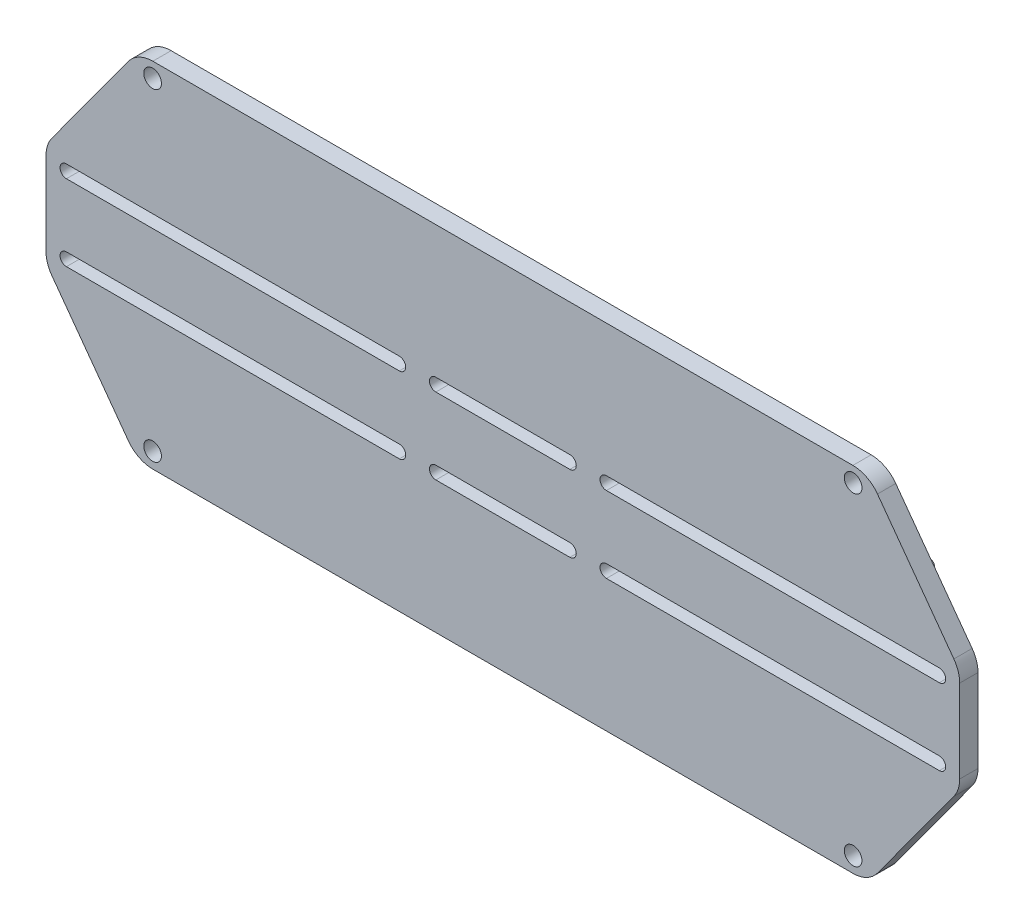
ISO-10303-21;
HEADER;
FILE_DESCRIPTION(('STEP AP214'),'2;1');
FILE_NAME('part.step','',(''),(''),'','','');
FILE_SCHEMA(('AUTOMOTIVE_DESIGN { 1 0 10303 214 1 1 1 1 }'));
ENDSEC;
DATA;
#1=APPLICATION_CONTEXT('core data for automotive mechanical design processes');
#2=APPLICATION_PROTOCOL_DEFINITION('international standard','automotive_design',2000,#1);
#3=PRODUCT_CONTEXT('',#1,'mechanical');
#4=PRODUCT('Part','Part','',(#3));
#5=PRODUCT_RELATED_PRODUCT_CATEGORY('part','',(#4));
#6=PRODUCT_DEFINITION_FORMATION('','',#4);
#7=PRODUCT_DEFINITION_CONTEXT('part definition',#1,'design');
#8=PRODUCT_DEFINITION('design','',#6,#7);
#9=PRODUCT_DEFINITION_SHAPE('','',#8);
#10=(LENGTH_UNIT() NAMED_UNIT(*) SI_UNIT(.MILLI.,.METRE.));
#11=(NAMED_UNIT(*) PLANE_ANGLE_UNIT() SI_UNIT($,.RADIAN.));
#12=(NAMED_UNIT(*) SI_UNIT($,.STERADIAN.) SOLID_ANGLE_UNIT());
#13=UNCERTAINTY_MEASURE_WITH_UNIT(LENGTH_MEASURE(1.E-05),#10,'distance_accuracy_value','');
#14=(GEOMETRIC_REPRESENTATION_CONTEXT(3) GLOBAL_UNCERTAINTY_ASSIGNED_CONTEXT((#13)) GLOBAL_UNIT_ASSIGNED_CONTEXT((#10,
#11,#12)) REPRESENTATION_CONTEXT('',''));
#15=CARTESIAN_POINT('',(0.,0.,0.));
#16=DIRECTION('',(0.,0.,1.));
#17=DIRECTION('',(1.,0.,0.));
#18=AXIS2_PLACEMENT_3D('',#15,#16,#17);
#19=CARTESIAN_POINT('',(0.,-7.34999999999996,3.));
#20=DIRECTION('',(0.,-1.,0.));
#21=DIRECTION('',(1.,0.,0.));
#22=AXIS2_PLACEMENT_3D('',#19,#20,#21);
#23=PLANE('',#22);
#24=DIRECTION('',(-1.,0.,0.));
#25=VECTOR('',#24,1.);
#26=CARTESIAN_POINT('',(0.,-7.34999999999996,0.));
#27=LINE('',#26,#25);
#28=CARTESIAN_POINT('',(71.6481055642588,-7.34999999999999,0.));
#29=VERTEX_POINT('',#28);
#30=CARTESIAN_POINT('',(17.,-7.34999999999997,0.));
#31=VERTEX_POINT('',#30);
#32=EDGE_CURVE('E659',#29,#31,#27,.T.);
#33=ORIENTED_EDGE('',*,*,#32,.T.);
#34=DIRECTION('',(0.,0.,-1.));
#35=VECTOR('',#34,1.);
#36=CARTESIAN_POINT('',(17.,-7.34999999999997,3.));
#37=LINE('',#36,#35);
#38=CARTESIAN_POINT('',(17.,-7.34999999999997,3.));
#39=VERTEX_POINT('',#38);
#40=EDGE_CURVE('E680',#39,#31,#37,.T.);
#41=ORIENTED_EDGE('',*,*,#40,.F.);
#42=DIRECTION('',(-1.,0.,0.));
#43=VECTOR('',#42,1.);
#44=CARTESIAN_POINT('',(0.,-7.34999999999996,3.));
#45=LINE('',#44,#43);
#46=CARTESIAN_POINT('',(71.6481055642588,-7.34999999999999,3.));
#47=VERTEX_POINT('',#46);
#48=EDGE_CURVE('E520',#47,#39,#45,.T.);
#49=ORIENTED_EDGE('',*,*,#48,.F.);
#50=DIRECTION('',(0.,0.,-1.));
#51=VECTOR('',#50,1.);
#52=CARTESIAN_POINT('',(71.6481055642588,-7.34999999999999,3.));
#53=LINE('',#52,#51);
#54=EDGE_CURVE('E670',#47,#29,#53,.T.);
#55=ORIENTED_EDGE('',*,*,#54,.T.);
#56=EDGE_LOOP('',(#33,#41,#49,#55));
#57=FACE_BOUND('',#56,.T.);
#58=ADVANCED_FACE('F41',(#57),#23,.F.);
#59=CARTESIAN_POINT('',(17.,-6.29999999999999,3.));
#60=DIRECTION('',(0.,0.,-1.));
#61=DIRECTION('',(-1.,0.,0.));
#62=AXIS2_PLACEMENT_3D('',#59,#60,#61);
#63=CYLINDRICAL_SURFACE('',#62,1.05);
#64=CARTESIAN_POINT('',(17.,-6.29999999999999,0.));
#65=DIRECTION('',(0.,0.,1.));
#66=DIRECTION('',(1.,0.,0.));
#67=AXIS2_PLACEMENT_3D('',#64,#65,#66);
#68=CIRCLE('',#67,1.05);
#69=CARTESIAN_POINT('',(17.,-5.24999999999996,0.));
#70=VERTEX_POINT('',#69);
#71=EDGE_CURVE('E663',#31,#70,#68,.F.);
#72=ORIENTED_EDGE('',*,*,#71,.T.);
#73=DIRECTION('',(0.,0.,-1.));
#74=VECTOR('',#73,1.);
#75=CARTESIAN_POINT('',(17.,-5.24999999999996,3.));
#76=LINE('',#75,#74);
#77=CARTESIAN_POINT('',(17.,-5.24999999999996,3.));
#78=VERTEX_POINT('',#77);
#79=EDGE_CURVE('E677',#78,#70,#76,.T.);
#80=ORIENTED_EDGE('',*,*,#79,.F.);
#81=CARTESIAN_POINT('',(17.,-6.29999999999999,3.));
#82=DIRECTION('',(0.,0.,1.));
#83=DIRECTION('',(1.,0.,0.));
#84=AXIS2_PLACEMENT_3D('',#81,#82,#83);
#85=CIRCLE('',#84,1.05);
#86=EDGE_CURVE('E524',#39,#78,#85,.F.);
#87=ORIENTED_EDGE('',*,*,#86,.F.);
#88=ORIENTED_EDGE('',*,*,#40,.T.);
#89=EDGE_LOOP('',(#72,#80,#87,#88));
#90=FACE_BOUND('',#89,.T.);
#91=ADVANCED_FACE('F1073',(#90),#63,.F.);
#92=CARTESIAN_POINT('',(0.,-5.24999999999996,3.));
#93=DIRECTION('',(0.,-1.,0.));
#94=DIRECTION('',(1.,0.,0.));
#95=AXIS2_PLACEMENT_3D('',#92,#93,#94);
#96=PLANE('',#95);
#97=DIRECTION('',(-1.,0.,0.));
#98=VECTOR('',#97,1.);
#99=CARTESIAN_POINT('',(0.,-5.24999999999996,0.));
#100=LINE('',#99,#98);
#101=CARTESIAN_POINT('',(71.6481055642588,-5.24999999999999,0.));
#102=VERTEX_POINT('',#101);
#103=EDGE_CURVE('E403',#102,#70,#100,.T.);
#104=ORIENTED_EDGE('',*,*,#103,.F.);
#105=DIRECTION('',(0.,0.,-1.));
#106=VECTOR('',#105,1.);
#107=CARTESIAN_POINT('',(71.6481055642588,-5.24999999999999,3.));
#108=LINE('',#107,#106);
#109=CARTESIAN_POINT('',(71.6481055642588,-5.24999999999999,3.));
#110=VERTEX_POINT('',#109);
#111=EDGE_CURVE('E673',#110,#102,#108,.T.);
#112=ORIENTED_EDGE('',*,*,#111,.F.);
#113=DIRECTION('',(-1.,0.,0.));
#114=VECTOR('',#113,1.);
#115=CARTESIAN_POINT('',(0.,-5.24999999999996,3.));
#116=LINE('',#115,#114);
#117=EDGE_CURVE('E527',#110,#78,#116,.T.);
#118=ORIENTED_EDGE('',*,*,#117,.T.);
#119=ORIENTED_EDGE('',*,*,#79,.T.);
#120=EDGE_LOOP('',(#104,#112,#118,#119));
#121=FACE_BOUND('',#120,.T.);
#122=ADVANCED_FACE('F1070',(#121),#96,.T.);
#123=CARTESIAN_POINT('',(0.,5.14999999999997,3.));
#124=DIRECTION('',(0.,-1.,0.));
#125=DIRECTION('',(1.,0.,0.));
#126=AXIS2_PLACEMENT_3D('',#123,#124,#125);
#127=PLANE('',#126);
#128=DIRECTION('',(-1.,0.,0.));
#129=VECTOR('',#128,1.);
#130=CARTESIAN_POINT('',(0.,5.14999999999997,0.));
#131=LINE('',#130,#129);
#132=CARTESIAN_POINT('',(11.,5.14999999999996,0.));
#133=VERTEX_POINT('',#132);
#134=CARTESIAN_POINT('',(-11.,5.14999999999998,0.));
#135=VERTEX_POINT('',#134);
#136=EDGE_CURVE('E644',#133,#135,#131,.T.);
#137=ORIENTED_EDGE('',*,*,#136,.T.);
#138=DIRECTION('',(0.,0.,-1.));
#139=VECTOR('',#138,1.);
#140=CARTESIAN_POINT('',(-11.,5.14999999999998,3.));
#141=LINE('',#140,#139);
#142=CARTESIAN_POINT('',(-11.,5.14999999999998,3.));
#143=VERTEX_POINT('',#142);
#144=EDGE_CURVE('E674',#143,#135,#141,.T.);
#145=ORIENTED_EDGE('',*,*,#144,.F.);
#146=DIRECTION('',(-1.,0.,0.));
#147=VECTOR('',#146,1.);
#148=CARTESIAN_POINT('',(0.,5.14999999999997,3.));
#149=LINE('',#148,#147);
#150=CARTESIAN_POINT('',(11.,5.14999999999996,3.));
#151=VERTEX_POINT('',#150);
#152=EDGE_CURVE('E506',#151,#143,#149,.T.);
#153=ORIENTED_EDGE('',*,*,#152,.F.);
#154=DIRECTION('',(0.,0.,-1.));
#155=VECTOR('',#154,1.);
#156=CARTESIAN_POINT('',(11.,5.14999999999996,3.));
#157=LINE('',#156,#155);
#158=EDGE_CURVE('E685',#151,#133,#157,.T.);
#159=ORIENTED_EDGE('',*,*,#158,.T.);
#160=EDGE_LOOP('',(#137,#145,#153,#159));
#161=FACE_BOUND('',#160,.T.);
#162=ADVANCED_FACE('F1105',(#161),#127,.F.);
#163=CARTESIAN_POINT('',(-11.,6.19999999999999,3.));
#164=DIRECTION('',(0.,0.,-1.));
#165=DIRECTION('',(-1.,0.,0.));
#166=AXIS2_PLACEMENT_3D('',#163,#164,#165);
#167=CYLINDRICAL_SURFACE('',#166,1.05);
#168=CARTESIAN_POINT('',(-11.,6.19999999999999,0.));
#169=DIRECTION('',(0.,0.,1.));
#170=DIRECTION('',(1.,0.,0.));
#171=AXIS2_PLACEMENT_3D('',#168,#169,#170);
#172=CIRCLE('',#171,1.05);
#173=CARTESIAN_POINT('',(-11.,7.24999999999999,0.));
#174=VERTEX_POINT('',#173);
#175=EDGE_CURVE('E648',#135,#174,#172,.F.);
#176=ORIENTED_EDGE('',*,*,#175,.T.);
#177=DIRECTION('',(0.,0.,-1.));
#178=VECTOR('',#177,1.);
#179=CARTESIAN_POINT('',(-11.,7.24999999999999,3.));
#180=LINE('',#179,#178);
#181=CARTESIAN_POINT('',(-11.,7.24999999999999,3.));
#182=VERTEX_POINT('',#181);
#183=EDGE_CURVE('E692',#182,#174,#180,.T.);
#184=ORIENTED_EDGE('',*,*,#183,.F.);
#185=CARTESIAN_POINT('',(-11.,6.19999999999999,3.));
#186=DIRECTION('',(0.,0.,1.));
#187=DIRECTION('',(1.,0.,0.));
#188=AXIS2_PLACEMENT_3D('',#185,#186,#187);
#189=CIRCLE('',#188,1.05);
#190=EDGE_CURVE('E510',#143,#182,#189,.F.);
#191=ORIENTED_EDGE('',*,*,#190,.F.);
#192=ORIENTED_EDGE('',*,*,#144,.T.);
#193=EDGE_LOOP('',(#176,#184,#191,#192));
#194=FACE_BOUND('',#193,.T.);
#195=ADVANCED_FACE('F1101',(#194),#167,.F.);
#196=CARTESIAN_POINT('',(0.,7.24999999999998,3.));
#197=DIRECTION('',(0.,1.,0.));
#198=DIRECTION('',(-1.,0.,0.));
#199=AXIS2_PLACEMENT_3D('',#196,#197,#198);
#200=PLANE('',#199);
#201=DIRECTION('',(1.,0.,0.));
#202=VECTOR('',#201,1.);
#203=CARTESIAN_POINT('',(0.,7.24999999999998,0.));
#204=LINE('',#203,#202);
#205=CARTESIAN_POINT('',(11.,7.24999999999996,0.));
#206=VERTEX_POINT('',#205);
#207=EDGE_CURVE('E651',#174,#206,#204,.T.);
#208=ORIENTED_EDGE('',*,*,#207,.T.);
#209=DIRECTION('',(0.,0.,-1.));
#210=VECTOR('',#209,1.);
#211=CARTESIAN_POINT('',(11.,7.24999999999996,3.));
#212=LINE('',#211,#210);
#213=CARTESIAN_POINT('',(11.,7.24999999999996,3.));
#214=VERTEX_POINT('',#213);
#215=EDGE_CURVE('E688',#214,#206,#212,.T.);
#216=ORIENTED_EDGE('',*,*,#215,.F.);
#217=DIRECTION('',(1.,0.,0.));
#218=VECTOR('',#217,1.);
#219=CARTESIAN_POINT('',(0.,7.24999999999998,3.));
#220=LINE('',#219,#218);
#221=EDGE_CURVE('E513',#182,#214,#220,.T.);
#222=ORIENTED_EDGE('',*,*,#221,.F.);
#223=ORIENTED_EDGE('',*,*,#183,.T.);
#224=EDGE_LOOP('',(#208,#216,#222,#223));
#225=FACE_BOUND('',#224,.T.);
#226=ADVANCED_FACE('F1097',(#225),#200,.F.);
#227=CARTESIAN_POINT('',(0.,7.24999999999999,3.));
#228=DIRECTION('',(0.,1.,0.));
#229=DIRECTION('',(0.,0.,1.));
#230=AXIS2_PLACEMENT_3D('',#227,#228,#229);
#231=PLANE('',#230);
#232=DIRECTION('',(1.,0.,0.));
#233=VECTOR('',#232,1.);
#234=CARTESIAN_POINT('',(0.,7.24999999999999,0.));
#235=LINE('',#234,#233);
#236=CARTESIAN_POINT('',(-71.6481055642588,7.24999999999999,0.));
#237=VERTEX_POINT('',#236);
#238=CARTESIAN_POINT('',(-17.,7.24999999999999,0.));
#239=VERTEX_POINT('',#238);
#240=EDGE_CURVE('E628',#237,#239,#235,.T.);
#241=ORIENTED_EDGE('',*,*,#240,.T.);
#242=DIRECTION('',(0.,0.,-1.));
#243=VECTOR('',#242,1.);
#244=CARTESIAN_POINT('',(-17.,7.24999999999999,3.));
#245=LINE('',#244,#243);
#246=CARTESIAN_POINT('',(-17.,7.24999999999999,3.));
#247=VERTEX_POINT('',#246);
#248=EDGE_CURVE('E689',#247,#239,#245,.T.);
#249=ORIENTED_EDGE('',*,*,#248,.F.);
#250=DIRECTION('',(1.,0.,0.));
#251=VECTOR('',#250,1.);
#252=CARTESIAN_POINT('',(0.,7.24999999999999,3.));
#253=LINE('',#252,#251);
#254=CARTESIAN_POINT('',(-71.6481055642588,7.24999999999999,3.));
#255=VERTEX_POINT('',#254);
#256=EDGE_CURVE('E491',#255,#247,#253,.T.);
#257=ORIENTED_EDGE('',*,*,#256,.F.);
#258=DIRECTION('',(0.,0.,-1.));
#259=VECTOR('',#258,1.);
#260=CARTESIAN_POINT('',(-71.6481055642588,7.24999999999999,3.));
#261=LINE('',#260,#259);
#262=EDGE_CURVE('E699',#255,#237,#261,.T.);
#263=ORIENTED_EDGE('',*,*,#262,.T.);
#264=EDGE_LOOP('',(#241,#249,#257,#263));
#265=FACE_BOUND('',#264,.T.);
#266=ADVANCED_FACE('F1100',(#265),#231,.F.);
#267=CARTESIAN_POINT('',(-17.,6.19999999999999,3.));
#268=DIRECTION('',(0.,0.,-1.));
#269=DIRECTION('',(-1.,0.,0.));
#270=AXIS2_PLACEMENT_3D('',#267,#268,#269);
#271=CYLINDRICAL_SURFACE('',#270,1.05);
#272=CARTESIAN_POINT('',(-17.,6.19999999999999,0.));
#273=DIRECTION('',(0.,0.,1.));
#274=DIRECTION('',(1.,0.,0.));
#275=AXIS2_PLACEMENT_3D('',#272,#273,#274);
#276=CIRCLE('',#275,1.05);
#277=CARTESIAN_POINT('',(-17.,5.14999999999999,0.));
#278=VERTEX_POINT('',#277);
#279=EDGE_CURVE('E632',#239,#278,#276,.F.);
#280=ORIENTED_EDGE('',*,*,#279,.T.);
#281=DIRECTION('',(0.,0.,-1.));
#282=VECTOR('',#281,1.);
#283=CARTESIAN_POINT('',(-17.,5.14999999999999,3.));
#284=LINE('',#283,#282);
#285=CARTESIAN_POINT('',(-17.,5.14999999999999,3.));
#286=VERTEX_POINT('',#285);
#287=EDGE_CURVE('E706',#286,#278,#284,.T.);
#288=ORIENTED_EDGE('',*,*,#287,.F.);
#289=CARTESIAN_POINT('',(-17.,6.19999999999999,3.));
#290=DIRECTION('',(0.,0.,1.));
#291=DIRECTION('',(1.,0.,0.));
#292=AXIS2_PLACEMENT_3D('',#289,#290,#291);
#293=CIRCLE('',#292,1.05);
#294=EDGE_CURVE('E495',#247,#286,#293,.F.);
#295=ORIENTED_EDGE('',*,*,#294,.F.);
#296=ORIENTED_EDGE('',*,*,#248,.T.);
#297=EDGE_LOOP('',(#280,#288,#295,#296));
#298=FACE_BOUND('',#297,.T.);
#299=ADVANCED_FACE('F1118',(#298),#271,.F.);
#300=CARTESIAN_POINT('',(0.,5.14999999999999,3.));
#301=DIRECTION('',(0.,1.,0.));
#302=DIRECTION('',(0.,0.,1.));
#303=AXIS2_PLACEMENT_3D('',#300,#301,#302);
#304=PLANE('',#303);
#305=DIRECTION('',(1.,0.,0.));
#306=VECTOR('',#305,1.);
#307=CARTESIAN_POINT('',(0.,5.14999999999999,0.));
#308=LINE('',#307,#306);
#309=CARTESIAN_POINT('',(-71.6481055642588,5.14999999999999,0.));
#310=VERTEX_POINT('',#309);
#311=EDGE_CURVE('E636',#310,#278,#308,.T.);
#312=ORIENTED_EDGE('',*,*,#311,.F.);
#313=DIRECTION('',(0.,0.,-1.));
#314=VECTOR('',#313,1.);
#315=CARTESIAN_POINT('',(-71.6481055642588,5.14999999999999,3.));
#316=LINE('',#315,#314);
#317=CARTESIAN_POINT('',(-71.6481055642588,5.14999999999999,3.));
#318=VERTEX_POINT('',#317);
#319=EDGE_CURVE('E702',#318,#310,#316,.T.);
#320=ORIENTED_EDGE('',*,*,#319,.F.);
#321=DIRECTION('',(1.,0.,0.));
#322=VECTOR('',#321,1.);
#323=CARTESIAN_POINT('',(0.,5.14999999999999,3.));
#324=LINE('',#323,#322);
#325=EDGE_CURVE('E498',#318,#286,#324,.T.);
#326=ORIENTED_EDGE('',*,*,#325,.T.);
#327=ORIENTED_EDGE('',*,*,#287,.T.);
#328=EDGE_LOOP('',(#312,#320,#326,#327));
#329=FACE_BOUND('',#328,.T.);
#330=ADVANCED_FACE('F1114',(#329),#304,.T.);
#331=CARTESIAN_POINT('',(52.9780319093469,-38.6700962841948,3.));
#332=DIRECTION('',(0.807715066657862,-0.589573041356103,0.));
#333=DIRECTION('',(0.589573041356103,0.807715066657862,0.));
#334=AXIS2_PLACEMENT_3D('',#331,#332,#333);
#335=PLANE('',#334);
#336=DIRECTION('',(-0.589573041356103,-0.807715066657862,0.));
#337=VECTOR('',#336,1.);
#338=CARTESIAN_POINT('',(52.9780319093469,-38.6700962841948,3.));
#339=LINE('',#338,#337);
#340=CARTESIAN_POINT('',(74.0385753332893,-9.81715179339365,3.));
#341=VERTEX_POINT('',#340);
#342=CARTESIAN_POINT('',(61.4979086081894,-26.9978652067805,3.));
#343=VERTEX_POINT('',#342);
#344=EDGE_CURVE('E459',#341,#343,#339,.T.);
#345=ORIENTED_EDGE('',*,*,#344,.T.);
#346=DIRECTION('',(0.,0.,-1.));
#347=VECTOR('',#346,1.);
#348=CARTESIAN_POINT('',(61.4979086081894,-26.9978652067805,0.));
#349=LINE('',#348,#347);
#350=CARTESIAN_POINT('',(61.4979086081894,-26.9978652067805,0.));
#351=VERTEX_POINT('',#350);
#352=EDGE_CURVE('E829',#343,#351,#349,.T.);
#353=ORIENTED_EDGE('',*,*,#352,.T.);
#354=DIRECTION('',(-0.589573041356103,-0.807715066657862,0.));
#355=VECTOR('',#354,1.);
#356=CARTESIAN_POINT('',(52.9780319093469,-38.6700962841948,0.));
#357=LINE('',#356,#355);
#358=CARTESIAN_POINT('',(74.0385753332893,-9.81715179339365,0.));
#359=VERTEX_POINT('',#358);
#360=EDGE_CURVE('E596',#359,#351,#357,.T.);
#361=ORIENTED_EDGE('',*,*,#360,.F.);
#362=DIRECTION('',(0.,0.,-1.));
#363=VECTOR('',#362,1.);
#364=CARTESIAN_POINT('',(74.0385753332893,-9.81715179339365,3.));
#365=LINE('',#364,#363);
#366=EDGE_CURVE('E826',#359,#341,#365,.F.);
#367=ORIENTED_EDGE('',*,*,#366,.T.);
#368=EDGE_LOOP('',(#345,#353,#361,#367));
#369=FACE_BOUND('',#368,.T.);
#370=ADVANCED_FACE('F1117',(#369),#335,.T.);
#371=CARTESIAN_POINT('',(75.,0.,3.));
#372=DIRECTION('',(-1.,0.,0.));
#373=DIRECTION('',(0.,0.,1.));
#374=AXIS2_PLACEMENT_3D('',#371,#372,#373);
#375=PLANE('',#374);
#376=DIRECTION('',(0.,1.,0.));
#377=VECTOR('',#376,1.);
#378=CARTESIAN_POINT('',(75.,0.,3.));
#379=LINE('',#378,#377);
#380=CARTESIAN_POINT('',(75.,-6.86928658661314,3.));
#381=VERTEX_POINT('',#380);
#382=CARTESIAN_POINT('',(75.,6.76928658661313,3.));
#383=VERTEX_POINT('',#382);
#384=EDGE_CURVE('E463',#381,#383,#379,.T.);
#385=ORIENTED_EDGE('',*,*,#384,.F.);
#386=DIRECTION('',(0.,0.,-1.));
#387=VECTOR('',#386,1.);
#388=CARTESIAN_POINT('',(75.,-6.86928658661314,0.));
#389=LINE('',#388,#387);
#390=CARTESIAN_POINT('',(75.,-6.86928658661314,0.));
#391=VERTEX_POINT('',#390);
#392=EDGE_CURVE('E836',#381,#391,#389,.T.);
#393=ORIENTED_EDGE('',*,*,#392,.T.);
#394=DIRECTION('',(0.,1.,0.));
#395=VECTOR('',#394,1.);
#396=CARTESIAN_POINT('',(75.,0.,0.));
#397=LINE('',#396,#395);
#398=CARTESIAN_POINT('',(75.,6.76928658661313,0.));
#399=VERTEX_POINT('',#398);
#400=EDGE_CURVE('E600',#391,#399,#397,.T.);
#401=ORIENTED_EDGE('',*,*,#400,.T.);
#402=DIRECTION('',(0.,0.,-1.));
#403=VECTOR('',#402,1.);
#404=CARTESIAN_POINT('',(75.,6.76928658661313,3.));
#405=LINE('',#404,#403);
#406=EDGE_CURVE('E833',#399,#383,#405,.F.);
#407=ORIENTED_EDGE('',*,*,#406,.T.);
#408=EDGE_LOOP('',(#385,#393,#401,#407));
#409=FACE_BOUND('',#408,.T.);
#410=ADVANCED_FACE('F1150',(#409),#375,.F.);
#411=CARTESIAN_POINT('',(52.930411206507,38.6353366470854,3.));
#412=DIRECTION('',(0.807715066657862,0.589573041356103,0.));
#413=DIRECTION('',(-0.589573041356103,0.807715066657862,0.));
#414=AXIS2_PLACEMENT_3D('',#411,#412,#413);
#415=PLANE('',#414);
#416=DIRECTION('',(0.589573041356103,-0.807715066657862,0.));
#417=VECTOR('',#416,1.);
#418=CARTESIAN_POINT('',(52.930411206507,38.6353366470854,3.));
#419=LINE('',#418,#417);
#420=CARTESIAN_POINT('',(61.4979086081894,26.8978652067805,3.));
#421=VERTEX_POINT('',#420);
#422=CARTESIAN_POINT('',(74.0385753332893,9.71715179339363,3.));
#423=VERTEX_POINT('',#422);
#424=EDGE_CURVE('E467',#421,#423,#419,.T.);
#425=ORIENTED_EDGE('',*,*,#424,.T.);
#426=DIRECTION('',(0.,0.,-1.));
#427=VECTOR('',#426,1.);
#428=CARTESIAN_POINT('',(74.0385753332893,9.71715179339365,0.));
#429=LINE('',#428,#427);
#430=CARTESIAN_POINT('',(74.0385753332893,9.71715179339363,0.));
#431=VERTEX_POINT('',#430);
#432=EDGE_CURVE('E843',#423,#431,#429,.T.);
#433=ORIENTED_EDGE('',*,*,#432,.T.);
#434=DIRECTION('',(0.589573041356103,-0.807715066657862,0.));
#435=VECTOR('',#434,1.);
#436=CARTESIAN_POINT('',(52.930411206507,38.6353366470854,0.));
#437=LINE('',#436,#435);
#438=CARTESIAN_POINT('',(61.4979086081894,26.8978652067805,0.));
#439=VERTEX_POINT('',#438);
#440=EDGE_CURVE('E604',#439,#431,#437,.T.);
#441=ORIENTED_EDGE('',*,*,#440,.F.);
#442=DIRECTION('',(0.,0.,-1.));
#443=VECTOR('',#442,1.);
#444=CARTESIAN_POINT('',(61.4979086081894,26.8978652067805,3.));
#445=LINE('',#444,#443);
#446=EDGE_CURVE('E840',#439,#421,#445,.F.);
#447=ORIENTED_EDGE('',*,*,#446,.T.);
#448=EDGE_LOOP('',(#425,#433,#441,#447));
#449=FACE_BOUND('',#448,.T.);
#450=ADVANCED_FACE('F1146',(#449),#415,.T.);
#451=CARTESIAN_POINT('',(0.,28.95,3.));
#452=DIRECTION('',(0.,1.,0.));
#453=DIRECTION('',(0.,0.,1.));
#454=AXIS2_PLACEMENT_3D('',#451,#452,#453);
#455=PLANE('',#454);
#456=DIRECTION('',(1.,0.,0.));
#457=VECTOR('',#456,1.);
#458=CARTESIAN_POINT('',(0.,28.95,0.));
#459=LINE('',#458,#457);
#460=CARTESIAN_POINT('',(-57.4593332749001,28.95,0.));
#461=VERTEX_POINT('',#460);
#462=CARTESIAN_POINT('',(57.4593332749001,28.95,0.));
#463=VERTEX_POINT('',#462);
#464=EDGE_CURVE('E608',#461,#463,#459,.T.);
#465=ORIENTED_EDGE('',*,*,#464,.F.);
#466=DIRECTION('',(0.,0.,-1.));
#467=VECTOR('',#466,1.);
#468=CARTESIAN_POINT('',(-57.4593332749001,28.95,3.));
#469=LINE('',#468,#467);
#470=CARTESIAN_POINT('',(-57.4593332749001,28.95,3.));
#471=VERTEX_POINT('',#470);
#472=EDGE_CURVE('E823',#461,#471,#469,.F.);
#473=ORIENTED_EDGE('',*,*,#472,.T.);
#474=DIRECTION('',(1.,0.,0.));
#475=VECTOR('',#474,1.);
#476=CARTESIAN_POINT('',(0.,28.95,3.));
#477=LINE('',#476,#475);
#478=CARTESIAN_POINT('',(57.4593332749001,28.95,3.));
#479=VERTEX_POINT('',#478);
#480=EDGE_CURVE('E471',#471,#479,#477,.T.);
#481=ORIENTED_EDGE('',*,*,#480,.T.);
#482=DIRECTION('',(0.,0.,-1.));
#483=VECTOR('',#482,1.);
#484=CARTESIAN_POINT('',(57.4593332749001,28.95,3.));
#485=LINE('',#484,#483);
#486=EDGE_CURVE('E819',#479,#463,#485,.T.);
#487=ORIENTED_EDGE('',*,*,#486,.T.);
#488=EDGE_LOOP('',(#465,#473,#481,#487));
#489=FACE_BOUND('',#488,.T.);
#490=ADVANCED_FACE('F1142',(#489),#455,.T.);
#491=CARTESIAN_POINT('',(-52.930411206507,38.6353366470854,3.));
#492=DIRECTION('',(0.807715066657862,-0.589573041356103,0.));
#493=DIRECTION('',(0.589573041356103,0.807715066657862,0.));
#494=AXIS2_PLACEMENT_3D('',#491,#492,#493);
#495=PLANE('',#494);
#496=DIRECTION('',(-0.589573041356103,-0.807715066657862,0.));
#497=VECTOR('',#496,1.);
#498=CARTESIAN_POINT('',(-52.930411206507,38.6353366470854,0.));
#499=LINE('',#498,#497);
#500=CARTESIAN_POINT('',(-61.4979086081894,26.8978652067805,0.));
#501=VERTEX_POINT('',#500);
#502=CARTESIAN_POINT('',(-74.0385753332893,9.71715179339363,0.));
#503=VERTEX_POINT('',#502);
#504=EDGE_CURVE('E612',#501,#503,#499,.T.);
#505=ORIENTED_EDGE('',*,*,#504,.T.);
#506=DIRECTION('',(0.,0.,-1.));
#507=VECTOR('',#506,1.);
#508=CARTESIAN_POINT('',(-74.0385753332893,9.71715179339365,3.));
#509=LINE('',#508,#507);
#510=CARTESIAN_POINT('',(-74.0385753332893,9.71715179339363,3.));
#511=VERTEX_POINT('',#510);
#512=EDGE_CURVE('E816',#503,#511,#509,.F.);
#513=ORIENTED_EDGE('',*,*,#512,.T.);
#514=DIRECTION('',(-0.589573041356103,-0.807715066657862,0.));
#515=VECTOR('',#514,1.);
#516=CARTESIAN_POINT('',(-52.930411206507,38.6353366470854,3.));
#517=LINE('',#516,#515);
#518=CARTESIAN_POINT('',(-61.4979086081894,26.8978652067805,3.));
#519=VERTEX_POINT('',#518);
#520=EDGE_CURVE('E475',#519,#511,#517,.T.);
#521=ORIENTED_EDGE('',*,*,#520,.F.);
#522=DIRECTION('',(0.,0.,-1.));
#523=VECTOR('',#522,1.);
#524=CARTESIAN_POINT('',(-61.4979086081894,26.8978652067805,0.));
#525=LINE('',#524,#523);
#526=EDGE_CURVE('E812',#519,#501,#525,.T.);
#527=ORIENTED_EDGE('',*,*,#526,.T.);
#528=EDGE_LOOP('',(#505,#513,#521,#527));
#529=FACE_BOUND('',#528,.T.);
#530=ADVANCED_FACE('F1138',(#529),#495,.F.);
#531=CARTESIAN_POINT('',(-75.,0.,3.));
#532=DIRECTION('',(-1.,0.,0.));
#533=DIRECTION('',(0.,0.,1.));
#534=AXIS2_PLACEMENT_3D('',#531,#532,#533);
#535=PLANE('',#534);
#536=DIRECTION('',(0.,1.,0.));
#537=VECTOR('',#536,1.);
#538=CARTESIAN_POINT('',(-75.,0.,0.));
#539=LINE('',#538,#537);
#540=CARTESIAN_POINT('',(-75.,-6.86928658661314,0.));
#541=VERTEX_POINT('',#540);
#542=CARTESIAN_POINT('',(-75.,6.76928658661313,0.));
#543=VERTEX_POINT('',#542);
#544=EDGE_CURVE('E616',#541,#543,#539,.T.);
#545=ORIENTED_EDGE('',*,*,#544,.F.);
#546=DIRECTION('',(0.,0.,-1.));
#547=VECTOR('',#546,1.);
#548=CARTESIAN_POINT('',(-75.,-6.86928658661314,3.));
#549=LINE('',#548,#547);
#550=CARTESIAN_POINT('',(-75.,-6.86928658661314,3.));
#551=VERTEX_POINT('',#550);
#552=EDGE_CURVE('E809',#541,#551,#549,.F.);
#553=ORIENTED_EDGE('',*,*,#552,.T.);
#554=DIRECTION('',(0.,1.,0.));
#555=VECTOR('',#554,1.);
#556=CARTESIAN_POINT('',(-75.,0.,3.));
#557=LINE('',#556,#555);
#558=CARTESIAN_POINT('',(-75.,6.76928658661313,3.));
#559=VERTEX_POINT('',#558);
#560=EDGE_CURVE('E479',#551,#559,#557,.T.);
#561=ORIENTED_EDGE('',*,*,#560,.T.);
#562=DIRECTION('',(0.,0.,-1.));
#563=VECTOR('',#562,1.);
#564=CARTESIAN_POINT('',(-75.,6.76928658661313,0.));
#565=LINE('',#564,#563);
#566=EDGE_CURVE('E805',#559,#543,#565,.T.);
#567=ORIENTED_EDGE('',*,*,#566,.T.);
#568=EDGE_LOOP('',(#545,#553,#561,#567));
#569=FACE_BOUND('',#568,.T.);
#570=ADVANCED_FACE('F1134',(#569),#535,.T.);
#571=CARTESIAN_POINT('',(-52.9780319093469,-38.6700962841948,3.));
#572=DIRECTION('',(0.807715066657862,0.589573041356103,0.));
#573=DIRECTION('',(-0.589573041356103,0.807715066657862,0.));
#574=AXIS2_PLACEMENT_3D('',#571,#572,#573);
#575=PLANE('',#574);
#576=DIRECTION('',(0.589573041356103,-0.807715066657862,0.));
#577=VECTOR('',#576,1.);
#578=CARTESIAN_POINT('',(-52.9780319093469,-38.6700962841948,0.));
#579=LINE('',#578,#577);
#580=CARTESIAN_POINT('',(-74.0385753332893,-9.81715179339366,0.));
#581=VERTEX_POINT('',#580);
#582=CARTESIAN_POINT('',(-61.4979086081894,-26.9978652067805,0.));
#583=VERTEX_POINT('',#582);
#584=EDGE_CURVE('E620',#581,#583,#579,.T.);
#585=ORIENTED_EDGE('',*,*,#584,.T.);
#586=DIRECTION('',(0.,0.,-1.));
#587=VECTOR('',#586,1.);
#588=CARTESIAN_POINT('',(-61.4979086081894,-26.9978652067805,3.));
#589=LINE('',#588,#587);
#590=CARTESIAN_POINT('',(-61.4979086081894,-26.9978652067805,3.));
#591=VERTEX_POINT('',#590);
#592=EDGE_CURVE('E778',#583,#591,#589,.F.);
#593=ORIENTED_EDGE('',*,*,#592,.T.);
#594=DIRECTION('',(0.589573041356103,-0.807715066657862,0.));
#595=VECTOR('',#594,1.);
#596=CARTESIAN_POINT('',(-52.9780319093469,-38.6700962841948,3.));
#597=LINE('',#596,#595);
#598=CARTESIAN_POINT('',(-74.0385753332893,-9.81715179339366,3.));
#599=VERTEX_POINT('',#598);
#600=EDGE_CURVE('E483',#599,#591,#597,.T.);
#601=ORIENTED_EDGE('',*,*,#600,.F.);
#602=DIRECTION('',(0.,0.,-1.));
#603=VECTOR('',#602,1.);
#604=CARTESIAN_POINT('',(-74.0385753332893,-9.81715179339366,0.));
#605=LINE('',#604,#603);
#606=EDGE_CURVE('E774',#599,#581,#605,.T.);
#607=ORIENTED_EDGE('',*,*,#606,.T.);
#608=EDGE_LOOP('',(#585,#593,#601,#607));
#609=FACE_BOUND('',#608,.T.);
#610=ADVANCED_FACE('F1130',(#609),#575,.F.);
#611=CARTESIAN_POINT('',(17.,6.19999999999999,3.));
#612=DIRECTION('',(0.,0.,-1.));
#613=DIRECTION('',(-1.,0.,0.));
#614=AXIS2_PLACEMENT_3D('',#611,#612,#613);
#615=CYLINDRICAL_SURFACE('',#614,1.05);
#616=CARTESIAN_POINT('',(17.,6.19999999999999,0.));
#617=DIRECTION('',(0.,0.,1.));
#618=DIRECTION('',(1.,0.,0.));
#619=AXIS2_PLACEMENT_3D('',#616,#617,#618);
#620=CIRCLE('',#619,1.05);
#621=CARTESIAN_POINT('',(17.,7.24999999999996,0.));
#622=VERTEX_POINT('',#621);
#623=CARTESIAN_POINT('',(17.,5.14999999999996,0.));
#624=VERTEX_POINT('',#623);
#625=EDGE_CURVE('E564',#622,#624,#620,.T.);
#626=ORIENTED_EDGE('',*,*,#625,.F.);
#627=DIRECTION('',(0.,0.,-1.));
#628=VECTOR('',#627,1.);
#629=CARTESIAN_POINT('',(17.,7.24999999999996,3.));
#630=LINE('',#629,#628);
#631=CARTESIAN_POINT('',(17.,7.24999999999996,3.));
#632=VERTEX_POINT('',#631);
#633=EDGE_CURVE('E703',#632,#622,#630,.T.);
#634=ORIENTED_EDGE('',*,*,#633,.F.);
#635=CARTESIAN_POINT('',(17.,6.19999999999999,3.));
#636=DIRECTION('',(0.,0.,1.));
#637=DIRECTION('',(1.,0.,0.));
#638=AXIS2_PLACEMENT_3D('',#635,#636,#637);
#639=CIRCLE('',#638,1.05);
#640=CARTESIAN_POINT('',(17.,5.14999999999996,3.));
#641=VERTEX_POINT('',#640);
#642=EDGE_CURVE('E428',#632,#641,#639,.T.);
#643=ORIENTED_EDGE('',*,*,#642,.T.);
#644=DIRECTION('',(0.,0.,-1.));
#645=VECTOR('',#644,1.);
#646=CARTESIAN_POINT('',(17.,5.14999999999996,3.));
#647=LINE('',#646,#645);
#648=EDGE_CURVE('E712',#641,#624,#647,.T.);
#649=ORIENTED_EDGE('',*,*,#648,.T.);
#650=EDGE_LOOP('',(#626,#634,#643,#649));
#651=FACE_BOUND('',#650,.T.);
#652=ADVANCED_FACE('F1133',(#651),#615,.F.);
#653=CARTESIAN_POINT('',(0.,7.24999999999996,3.));
#654=DIRECTION('',(0.,1.,0.));
#655=DIRECTION('',(-1.,0.,0.));
#656=AXIS2_PLACEMENT_3D('',#653,#654,#655);
#657=PLANE('',#656);
#658=DIRECTION('',(1.,0.,0.));
#659=VECTOR('',#658,1.);
#660=CARTESIAN_POINT('',(0.,7.24999999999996,0.));
#661=LINE('',#660,#659);
#662=CARTESIAN_POINT('',(71.6481055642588,7.24999999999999,0.));
#663=VERTEX_POINT('',#662);
#664=EDGE_CURVE('E568',#622,#663,#661,.T.);
#665=ORIENTED_EDGE('',*,*,#664,.T.);
#666=DIRECTION('',(0.,0.,-1.));
#667=VECTOR('',#666,1.);
#668=CARTESIAN_POINT('',(71.6481055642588,7.24999999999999,3.));
#669=LINE('',#668,#667);
#670=CARTESIAN_POINT('',(71.6481055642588,7.24999999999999,3.));
#671=VERTEX_POINT('',#670);
#672=EDGE_CURVE('E719',#671,#663,#669,.T.);
#673=ORIENTED_EDGE('',*,*,#672,.F.);
#674=DIRECTION('',(1.,0.,0.));
#675=VECTOR('',#674,1.);
#676=CARTESIAN_POINT('',(0.,7.24999999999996,3.));
#677=LINE('',#676,#675);
#678=EDGE_CURVE('E432',#632,#671,#677,.T.);
#679=ORIENTED_EDGE('',*,*,#678,.F.);
#680=ORIENTED_EDGE('',*,*,#633,.T.);
#681=EDGE_LOOP('',(#665,#673,#679,#680));
#682=FACE_BOUND('',#681,.T.);
#683=ADVANCED_FACE('F1182',(#682),#657,.F.);
#684=CARTESIAN_POINT('',(71.6481055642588,6.19999999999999,3.));
#685=DIRECTION('',(0.,0.,-1.));
#686=DIRECTION('',(-1.,0.,0.));
#687=AXIS2_PLACEMENT_3D('',#684,#685,#686);
#688=CYLINDRICAL_SURFACE('',#687,1.05);
#689=CARTESIAN_POINT('',(71.6481055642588,6.19999999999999,0.));
#690=DIRECTION('',(0.,0.,1.));
#691=DIRECTION('',(1.,0.,0.));
#692=AXIS2_PLACEMENT_3D('',#689,#690,#691);
#693=CIRCLE('',#692,1.05);
#694=CARTESIAN_POINT('',(71.6481055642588,5.14999999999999,0.));
#695=VERTEX_POINT('',#694);
#696=EDGE_CURVE('E572',#663,#695,#693,.F.);
#697=ORIENTED_EDGE('',*,*,#696,.T.);
#698=DIRECTION('',(0.,0.,-1.));
#699=VECTOR('',#698,1.);
#700=CARTESIAN_POINT('',(71.6481055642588,5.14999999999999,3.));
#701=LINE('',#700,#699);
#702=CARTESIAN_POINT('',(71.6481055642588,5.14999999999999,3.));
#703=VERTEX_POINT('',#702);
#704=EDGE_CURVE('E715',#703,#695,#701,.T.);
#705=ORIENTED_EDGE('',*,*,#704,.F.);
#706=CARTESIAN_POINT('',(71.6481055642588,6.19999999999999,3.));
#707=DIRECTION('',(0.,0.,1.));
#708=DIRECTION('',(1.,0.,0.));
#709=AXIS2_PLACEMENT_3D('',#706,#707,#708);
#710=CIRCLE('',#709,1.05);
#711=EDGE_CURVE('E436',#671,#703,#710,.F.);
#712=ORIENTED_EDGE('',*,*,#711,.F.);
#713=ORIENTED_EDGE('',*,*,#672,.T.);
#714=EDGE_LOOP('',(#697,#705,#712,#713));
#715=FACE_BOUND('',#714,.T.);
#716=ADVANCED_FACE('F1178',(#715),#688,.F.);
#717=CARTESIAN_POINT('',(-17.,-6.29999999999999,3.));
#718=DIRECTION('',(0.,0.,-1.));
#719=DIRECTION('',(-1.,0.,0.));
#720=AXIS2_PLACEMENT_3D('',#717,#718,#719);
#721=CYLINDRICAL_SURFACE('',#720,1.05);
#722=CARTESIAN_POINT('',(-17.,-6.29999999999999,0.));
#723=DIRECTION('',(0.,0.,1.));
#724=DIRECTION('',(1.,0.,0.));
#725=AXIS2_PLACEMENT_3D('',#722,#723,#724);
#726=CIRCLE('',#725,1.05);
#727=CARTESIAN_POINT('',(-17.,-7.34999999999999,0.));
#728=VERTEX_POINT('',#727);
#729=CARTESIAN_POINT('',(-17.,-5.24999999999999,0.));
#730=VERTEX_POINT('',#729);
#731=EDGE_CURVE('E548',#728,#730,#726,.T.);
#732=ORIENTED_EDGE('',*,*,#731,.F.);
#733=DIRECTION('',(0.,0.,-1.));
#734=VECTOR('',#733,1.);
#735=CARTESIAN_POINT('',(-17.,-7.34999999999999,3.));
#736=LINE('',#735,#734);
#737=CARTESIAN_POINT('',(-17.,-7.34999999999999,3.));
#738=VERTEX_POINT('',#737);
#739=EDGE_CURVE('E716',#738,#728,#736,.T.);
#740=ORIENTED_EDGE('',*,*,#739,.F.);
#741=CARTESIAN_POINT('',(-17.,-6.29999999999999,3.));
#742=DIRECTION('',(0.,0.,1.));
#743=DIRECTION('',(1.,0.,0.));
#744=AXIS2_PLACEMENT_3D('',#741,#742,#743);
#745=CIRCLE('',#744,1.05);
#746=CARTESIAN_POINT('',(-17.,-5.24999999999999,3.));
#747=VERTEX_POINT('',#746);
#748=EDGE_CURVE('E413',#738,#747,#745,.T.);
#749=ORIENTED_EDGE('',*,*,#748,.T.);
#750=DIRECTION('',(0.,0.,-1.));
#751=VECTOR('',#750,1.);
#752=CARTESIAN_POINT('',(-17.,-5.24999999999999,3.));
#753=LINE('',#752,#751);
#754=EDGE_CURVE('E381',#747,#730,#753,.T.);
#755=ORIENTED_EDGE('',*,*,#754,.T.);
#756=EDGE_LOOP('',(#732,#740,#749,#755));
#757=FACE_BOUND('',#756,.T.);
#758=ADVANCED_FACE('F1181',(#757),#721,.F.);
#759=CARTESIAN_POINT('',(0.,-7.34999999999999,3.));
#760=DIRECTION('',(0.,-1.,0.));
#761=DIRECTION('',(0.,0.,-1.));
#762=AXIS2_PLACEMENT_3D('',#759,#760,#761);
#763=PLANE('',#762);
#764=DIRECTION('',(-1.,0.,0.));
#765=VECTOR('',#764,1.);
#766=CARTESIAN_POINT('',(0.,-7.34999999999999,0.));
#767=LINE('',#766,#765);
#768=CARTESIAN_POINT('',(-71.6481055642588,-7.34999999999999,0.));
#769=VERTEX_POINT('',#768);
#770=EDGE_CURVE('E552',#728,#769,#767,.T.);
#771=ORIENTED_EDGE('',*,*,#770,.T.);
#772=DIRECTION('',(0.,0.,-1.));
#773=VECTOR('',#772,1.);
#774=CARTESIAN_POINT('',(-71.6481055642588,-7.34999999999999,3.));
#775=LINE('',#774,#773);
#776=CARTESIAN_POINT('',(-71.6481055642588,-7.34999999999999,3.));
#777=VERTEX_POINT('',#776);
#778=EDGE_CURVE('E730',#777,#769,#775,.T.);
#779=ORIENTED_EDGE('',*,*,#778,.F.);
#780=DIRECTION('',(-1.,0.,0.));
#781=VECTOR('',#780,1.);
#782=CARTESIAN_POINT('',(0.,-7.34999999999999,3.));
#783=LINE('',#782,#781);
#784=EDGE_CURVE('E417',#738,#777,#783,.T.);
#785=ORIENTED_EDGE('',*,*,#784,.F.);
#786=ORIENTED_EDGE('',*,*,#739,.T.);
#787=EDGE_LOOP('',(#771,#779,#785,#786));
#788=FACE_BOUND('',#787,.T.);
#789=ADVANCED_FACE('F1196',(#788),#763,.F.);
#790=CARTESIAN_POINT('',(-71.6481055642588,-6.29999999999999,3.));
#791=DIRECTION('',(0.,0.,-1.));
#792=DIRECTION('',(-1.,0.,0.));
#793=AXIS2_PLACEMENT_3D('',#790,#791,#792);
#794=CYLINDRICAL_SURFACE('',#793,1.05);
#795=CARTESIAN_POINT('',(-71.6481055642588,-6.29999999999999,0.));
#796=DIRECTION('',(0.,0.,1.));
#797=DIRECTION('',(1.,0.,0.));
#798=AXIS2_PLACEMENT_3D('',#795,#796,#797);
#799=CIRCLE('',#798,1.05);
#800=CARTESIAN_POINT('',(-71.6481055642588,-5.24999999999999,0.));
#801=VERTEX_POINT('',#800);
#802=EDGE_CURVE('E556',#769,#801,#799,.F.);
#803=ORIENTED_EDGE('',*,*,#802,.T.);
#804=DIRECTION('',(0.,0.,-1.));
#805=VECTOR('',#804,1.);
#806=CARTESIAN_POINT('',(-71.6481055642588,-5.24999999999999,3.));
#807=LINE('',#806,#805);
#808=CARTESIAN_POINT('',(-71.6481055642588,-5.24999999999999,3.));
#809=VERTEX_POINT('',#808);
#810=EDGE_CURVE('E727',#809,#801,#807,.T.);
#811=ORIENTED_EDGE('',*,*,#810,.F.);
#812=CARTESIAN_POINT('',(-71.6481055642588,-6.29999999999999,3.));
#813=DIRECTION('',(0.,0.,1.));
#814=DIRECTION('',(1.,0.,0.));
#815=AXIS2_PLACEMENT_3D('',#812,#813,#814);
#816=CIRCLE('',#815,1.05);
#817=EDGE_CURVE('E421',#777,#809,#816,.F.);
#818=ORIENTED_EDGE('',*,*,#817,.F.);
#819=ORIENTED_EDGE('',*,*,#778,.T.);
#820=EDGE_LOOP('',(#803,#811,#818,#819));
#821=FACE_BOUND('',#820,.T.);
#822=ADVANCED_FACE('F1193',(#821),#794,.F.);
#823=CARTESIAN_POINT('',(-11.,-6.29999999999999,3.));
#824=DIRECTION('',(0.,0.,-1.));
#825=DIRECTION('',(-1.,0.,0.));
#826=AXIS2_PLACEMENT_3D('',#823,#824,#825);
#827=CYLINDRICAL_SURFACE('',#826,1.05);
#828=CARTESIAN_POINT('',(-11.,-6.29999999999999,0.));
#829=DIRECTION('',(0.,0.,1.));
#830=DIRECTION('',(1.,0.,0.));
#831=AXIS2_PLACEMENT_3D('',#828,#829,#830);
#832=CIRCLE('',#831,1.05);
#833=CARTESIAN_POINT('',(-11.,-5.24999999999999,0.));
#834=VERTEX_POINT('',#833);
#835=CARTESIAN_POINT('',(-11.,-7.34999999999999,0.));
#836=VERTEX_POINT('',#835);
#837=EDGE_CURVE('E377',#834,#836,#832,.T.);
#838=ORIENTED_EDGE('',*,*,#837,.F.);
#839=DIRECTION('',(0.,0.,-1.));
#840=VECTOR('',#839,1.);
#841=CARTESIAN_POINT('',(-11.,-5.24999999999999,3.));
#842=LINE('',#841,#840);
#843=CARTESIAN_POINT('',(-11.,-5.24999999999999,3.));
#844=VERTEX_POINT('',#843);
#845=EDGE_CURVE('E371',#844,#834,#842,.T.);
#846=ORIENTED_EDGE('',*,*,#845,.F.);
#847=CARTESIAN_POINT('',(-11.,-6.29999999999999,3.));
#848=DIRECTION('',(0.,0.,1.));
#849=DIRECTION('',(1.,0.,0.));
#850=AXIS2_PLACEMENT_3D('',#847,#848,#849);
#851=CIRCLE('',#850,1.05);
#852=CARTESIAN_POINT('',(-11.,-7.34999999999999,3.));
#853=VERTEX_POINT('',#852);
#854=EDGE_CURVE('E375',#844,#853,#851,.T.);
#855=ORIENTED_EDGE('',*,*,#854,.T.);
#856=DIRECTION('',(0.,0.,-1.));
#857=VECTOR('',#856,1.);
#858=CARTESIAN_POINT('',(-11.,-7.34999999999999,3.));
#859=LINE('',#858,#857);
#860=EDGE_CURVE('E535',#853,#836,#859,.T.);
#861=ORIENTED_EDGE('',*,*,#860,.T.);
#862=EDGE_LOOP('',(#838,#846,#855,#861));
#863=FACE_BOUND('',#862,.T.);
#864=ADVANCED_FACE('F373',(#863),#827,.F.);
#865=CARTESIAN_POINT('',(0.,-5.24999999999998,3.));
#866=DIRECTION('',(0.,1.,0.));
#867=DIRECTION('',(-1.,0.,0.));
#868=AXIS2_PLACEMENT_3D('',#865,#866,#867);
#869=PLANE('',#868);
#870=DIRECTION('',(1.,0.,0.));
#871=VECTOR('',#870,1.);
#872=CARTESIAN_POINT('',(0.,-5.24999999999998,0.));
#873=LINE('',#872,#871);
#874=CARTESIAN_POINT('',(11.,-5.24999999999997,0.));
#875=VERTEX_POINT('',#874);
#876=EDGE_CURVE('E538',#834,#875,#873,.T.);
#877=ORIENTED_EDGE('',*,*,#876,.T.);
#878=DIRECTION('',(0.,0.,-1.));
#879=VECTOR('',#878,1.);
#880=CARTESIAN_POINT('',(11.,-5.24999999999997,3.));
#881=LINE('',#880,#879);
#882=CARTESIAN_POINT('',(11.,-5.24999999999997,3.));
#883=VERTEX_POINT('',#882);
#884=EDGE_CURVE('E382',#883,#875,#881,.T.);
#885=ORIENTED_EDGE('',*,*,#884,.F.);
#886=DIRECTION('',(1.,0.,0.));
#887=VECTOR('',#886,1.);
#888=CARTESIAN_POINT('',(0.,-5.24999999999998,3.));
#889=LINE('',#888,#887);
#890=EDGE_CURVE('E385',#844,#883,#889,.T.);
#891=ORIENTED_EDGE('',*,*,#890,.F.);
#892=ORIENTED_EDGE('',*,*,#845,.T.);
#893=EDGE_LOOP('',(#877,#885,#891,#892));
#894=FACE_BOUND('',#893,.T.);
#895=ADVANCED_FACE('F386',(#894),#869,.F.);
#896=CARTESIAN_POINT('',(11.,-6.29999999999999,3.));
#897=DIRECTION('',(0.,0.,-1.));
#898=DIRECTION('',(-1.,0.,0.));
#899=AXIS2_PLACEMENT_3D('',#896,#897,#898);
#900=CYLINDRICAL_SURFACE('',#899,1.05);
#901=CARTESIAN_POINT('',(11.,-6.29999999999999,0.));
#902=DIRECTION('',(0.,0.,1.));
#903=DIRECTION('',(1.,0.,0.));
#904=AXIS2_PLACEMENT_3D('',#901,#902,#903);
#905=CIRCLE('',#904,1.05);
#906=CARTESIAN_POINT('',(11.,-7.34999999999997,0.));
#907=VERTEX_POINT('',#906);
#908=EDGE_CURVE('E541',#875,#907,#905,.F.);
#909=ORIENTED_EDGE('',*,*,#908,.T.);
#910=DIRECTION('',(0.,0.,-1.));
#911=VECTOR('',#910,1.);
#912=CARTESIAN_POINT('',(11.,-7.34999999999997,3.));
#913=LINE('',#912,#911);
#914=CARTESIAN_POINT('',(11.,-7.34999999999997,3.));
#915=VERTEX_POINT('',#914);
#916=EDGE_CURVE('E738',#915,#907,#913,.T.);
#917=ORIENTED_EDGE('',*,*,#916,.F.);
#918=CARTESIAN_POINT('',(11.,-6.29999999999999,3.));
#919=DIRECTION('',(0.,0.,1.));
#920=DIRECTION('',(1.,0.,0.));
#921=AXIS2_PLACEMENT_3D('',#918,#919,#920);
#922=CIRCLE('',#921,1.05);
#923=EDGE_CURVE('E391',#883,#915,#922,.F.);
#924=ORIENTED_EDGE('',*,*,#923,.F.);
#925=ORIENTED_EDGE('',*,*,#884,.T.);
#926=EDGE_LOOP('',(#909,#917,#924,#925));
#927=FACE_BOUND('',#926,.T.);
#928=ADVANCED_FACE('F1095',(#927),#900,.F.);
#929=CARTESIAN_POINT('',(11.,6.19999999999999,3.));
#930=DIRECTION('',(0.,0.,-1.));
#931=DIRECTION('',(-1.,0.,0.));
#932=AXIS2_PLACEMENT_3D('',#929,#930,#931);
#933=CYLINDRICAL_SURFACE('',#932,1.05);
#934=CARTESIAN_POINT('',(11.,6.19999999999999,0.));
#935=DIRECTION('',(0.,0.,1.));
#936=DIRECTION('',(1.,0.,0.));
#937=AXIS2_PLACEMENT_3D('',#934,#935,#936);
#938=CIRCLE('',#937,1.05);
#939=EDGE_CURVE('E655',#133,#206,#938,.T.);
#940=ORIENTED_EDGE('',*,*,#939,.F.);
#941=ORIENTED_EDGE('',*,*,#158,.F.);
#942=CARTESIAN_POINT('',(11.,6.19999999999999,3.));
#943=DIRECTION('',(0.,0.,1.));
#944=DIRECTION('',(1.,0.,0.));
#945=AXIS2_PLACEMENT_3D('',#942,#943,#944);
#946=CIRCLE('',#945,1.05);
#947=EDGE_CURVE('E516',#151,#214,#946,.T.);
#948=ORIENTED_EDGE('',*,*,#947,.T.);
#949=ORIENTED_EDGE('',*,*,#215,.T.);
#950=EDGE_LOOP('',(#940,#941,#948,#949));
#951=FACE_BOUND('',#950,.T.);
#952=ADVANCED_FACE('F1091',(#951),#933,.F.);
#953=CARTESIAN_POINT('',(-71.6481055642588,6.19999999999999,3.));
#954=DIRECTION('',(0.,0.,-1.));
#955=DIRECTION('',(-1.,0.,0.));
#956=AXIS2_PLACEMENT_3D('',#953,#954,#955);
#957=CYLINDRICAL_SURFACE('',#956,1.05);
#958=CARTESIAN_POINT('',(-71.6481055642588,6.19999999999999,0.));
#959=DIRECTION('',(0.,0.,1.));
#960=DIRECTION('',(1.,0.,0.));
#961=AXIS2_PLACEMENT_3D('',#958,#959,#960);
#962=CIRCLE('',#961,1.05);
#963=EDGE_CURVE('E640',#237,#310,#962,.T.);
#964=ORIENTED_EDGE('',*,*,#963,.F.);
#965=ORIENTED_EDGE('',*,*,#262,.F.);
#966=CARTESIAN_POINT('',(-71.6481055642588,6.19999999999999,3.));
#967=DIRECTION('',(0.,0.,1.));
#968=DIRECTION('',(1.,0.,0.));
#969=AXIS2_PLACEMENT_3D('',#966,#967,#968);
#970=CIRCLE('',#969,1.05);
#971=EDGE_CURVE('E502',#255,#318,#970,.T.);
#972=ORIENTED_EDGE('',*,*,#971,.T.);
#973=ORIENTED_EDGE('',*,*,#319,.T.);
#974=EDGE_LOOP('',(#964,#965,#972,#973));
#975=FACE_BOUND('',#974,.T.);
#976=ADVANCED_FACE('F1094',(#975),#957,.F.);
#977=CARTESIAN_POINT('',(0.,-29.05,3.));
#978=DIRECTION('',(0.,1.,0.));
#979=DIRECTION('',(0.,0.,1.));
#980=AXIS2_PLACEMENT_3D('',#977,#978,#979);
#981=PLANE('',#980);
#982=DIRECTION('',(1.,0.,0.));
#983=VECTOR('',#982,1.);
#984=CARTESIAN_POINT('',(0.,-29.05,3.));
#985=LINE('',#984,#983);
#986=CARTESIAN_POINT('',(-57.4593332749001,-29.05,3.));
#987=VERTEX_POINT('',#986);
#988=CARTESIAN_POINT('',(57.4593332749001,-29.05,3.));
#989=VERTEX_POINT('',#988);
#990=EDGE_CURVE('E487',#987,#989,#985,.T.);
#991=ORIENTED_EDGE('',*,*,#990,.F.);
#992=DIRECTION('',(0.,0.,-1.));
#993=VECTOR('',#992,1.);
#994=CARTESIAN_POINT('',(-57.4593332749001,-29.05,3.));
#995=LINE('',#994,#993);
#996=CARTESIAN_POINT('',(-57.4593332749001,-29.05,0.));
#997=VERTEX_POINT('',#996);
#998=EDGE_CURVE('E746',#987,#997,#995,.T.);
#999=ORIENTED_EDGE('',*,*,#998,.T.);
#1000=DIRECTION('',(1.,0.,0.));
#1001=VECTOR('',#1000,1.);
#1002=CARTESIAN_POINT('',(0.,-29.05,0.));
#1003=LINE('',#1002,#1001);
#1004=CARTESIAN_POINT('',(57.4593332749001,-29.05,0.));
#1005=VERTEX_POINT('',#1004);
#1006=EDGE_CURVE('E624',#997,#1005,#1003,.T.);
#1007=ORIENTED_EDGE('',*,*,#1006,.T.);
#1008=DIRECTION('',(0.,0.,-1.));
#1009=VECTOR('',#1008,1.);
#1010=CARTESIAN_POINT('',(57.4593332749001,-29.05,3.));
#1011=LINE('',#1010,#1009);
#1012=EDGE_CURVE('E684',#1005,#989,#1011,.F.);
#1013=ORIENTED_EDGE('',*,*,#1012,.T.);
#1014=EDGE_LOOP('',(#991,#999,#1007,#1013));
#1015=FACE_BOUND('',#1014,.T.);
#1016=ADVANCED_FACE('F1112',(#1015),#981,.F.);
#1017=CARTESIAN_POINT('',(-57.5,26.5,3.));
#1018=DIRECTION('',(0.,0.,-1.));
#1019=DIRECTION('',(-1.,0.,0.));
#1020=AXIS2_PLACEMENT_3D('',#1017,#1018,#1019);
#1021=CYLINDRICAL_SURFACE('',#1020,1.44999999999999);
#1022=CARTESIAN_POINT('',(-57.5,26.5,3.));
#1023=DIRECTION('',(0.,0.,1.));
#1024=DIRECTION('',(1.,0.,0.));
#1025=AXIS2_PLACEMENT_3D('',#1022,#1023,#1024);
#1026=CIRCLE('',#1025,1.44999999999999);
#1027=CARTESIAN_POINT('',(-56.05,26.5,3.));
#1028=VERTEX_POINT('',#1027);
#1029=EDGE_CURVE('E455',#1028,#1028,#1026,.T.);
#1030=ORIENTED_EDGE('',*,*,#1029,.T.);
#1031=EDGE_LOOP('',(#1030));
#1032=FACE_BOUND('',#1031,.T.);
#1033=CARTESIAN_POINT('',(-57.5,26.5,0.));
#1034=DIRECTION('',(0.,0.,1.));
#1035=DIRECTION('',(1.,0.,0.));
#1036=AXIS2_PLACEMENT_3D('',#1033,#1034,#1035);
#1037=CIRCLE('',#1036,1.44999999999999);
#1038=CARTESIAN_POINT('',(-56.05,26.5,0.));
#1039=VERTEX_POINT('',#1038);
#1040=EDGE_CURVE('E592',#1039,#1039,#1037,.T.);
#1041=ORIENTED_EDGE('',*,*,#1040,.F.);
#1042=EDGE_LOOP('',(#1041));
#1043=FACE_BOUND('',#1042,.T.);
#1044=ADVANCED_FACE('F1128',(#1032,#1043),#1021,.F.);
#1045=CARTESIAN_POINT('',(-57.5,-26.5,3.));
#1046=DIRECTION('',(0.,0.,-1.));
#1047=DIRECTION('',(-1.,0.,0.));
#1048=AXIS2_PLACEMENT_3D('',#1045,#1046,#1047);
#1049=CYLINDRICAL_SURFACE('',#1048,1.44999999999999);
#1050=CARTESIAN_POINT('',(-57.5,-26.5,3.));
#1051=DIRECTION('',(0.,0.,1.));
#1052=DIRECTION('',(1.,0.,0.));
#1053=AXIS2_PLACEMENT_3D('',#1050,#1051,#1052);
#1054=CIRCLE('',#1053,1.44999999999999);
#1055=CARTESIAN_POINT('',(-56.05,-26.5,3.));
#1056=VERTEX_POINT('',#1055);
#1057=EDGE_CURVE('E451',#1056,#1056,#1054,.T.);
#1058=ORIENTED_EDGE('',*,*,#1057,.T.);
#1059=EDGE_LOOP('',(#1058));
#1060=FACE_BOUND('',#1059,.T.);
#1061=CARTESIAN_POINT('',(-57.5,-26.5,0.));
#1062=DIRECTION('',(0.,0.,1.));
#1063=DIRECTION('',(1.,0.,0.));
#1064=AXIS2_PLACEMENT_3D('',#1061,#1062,#1063);
#1065=CIRCLE('',#1064,1.44999999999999);
#1066=CARTESIAN_POINT('',(-56.05,-26.5,0.));
#1067=VERTEX_POINT('',#1066);
#1068=EDGE_CURVE('E588',#1067,#1067,#1065,.T.);
#1069=ORIENTED_EDGE('',*,*,#1068,.F.);
#1070=EDGE_LOOP('',(#1069));
#1071=FACE_BOUND('',#1070,.T.);
#1072=ADVANCED_FACE('F1160',(#1060,#1071),#1049,.F.);
#1073=CARTESIAN_POINT('',(57.5,26.5,3.));
#1074=DIRECTION('',(0.,0.,-1.));
#1075=DIRECTION('',(-1.,0.,0.));
#1076=AXIS2_PLACEMENT_3D('',#1073,#1074,#1075);
#1077=CYLINDRICAL_SURFACE('',#1076,1.44999999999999);
#1078=CARTESIAN_POINT('',(57.5,26.5,3.));
#1079=DIRECTION('',(0.,0.,1.));
#1080=DIRECTION('',(1.,0.,0.));
#1081=AXIS2_PLACEMENT_3D('',#1078,#1079,#1080);
#1082=CIRCLE('',#1081,1.44999999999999);
#1083=CARTESIAN_POINT('',(58.95,26.5,3.));
#1084=VERTEX_POINT('',#1083);
#1085=EDGE_CURVE('E447',#1084,#1084,#1082,.T.);
#1086=ORIENTED_EDGE('',*,*,#1085,.T.);
#1087=EDGE_LOOP('',(#1086));
#1088=FACE_BOUND('',#1087,.T.);
#1089=CARTESIAN_POINT('',(57.5,26.5,0.));
#1090=DIRECTION('',(0.,0.,1.));
#1091=DIRECTION('',(1.,0.,0.));
#1092=AXIS2_PLACEMENT_3D('',#1089,#1090,#1091);
#1093=CIRCLE('',#1092,1.44999999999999);
#1094=CARTESIAN_POINT('',(58.95,26.5,0.));
#1095=VERTEX_POINT('',#1094);
#1096=EDGE_CURVE('E584',#1095,#1095,#1093,.T.);
#1097=ORIENTED_EDGE('',*,*,#1096,.F.);
#1098=EDGE_LOOP('',(#1097));
#1099=FACE_BOUND('',#1098,.T.);
#1100=ADVANCED_FACE('F1164',(#1088,#1099),#1077,.F.);
#1101=CARTESIAN_POINT('',(57.5,-26.5,3.));
#1102=DIRECTION('',(0.,0.,-1.));
#1103=DIRECTION('',(-1.,0.,0.));
#1104=AXIS2_PLACEMENT_3D('',#1101,#1102,#1103);
#1105=CYLINDRICAL_SURFACE('',#1104,1.44999999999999);
#1106=CARTESIAN_POINT('',(57.5,-26.5,3.));
#1107=DIRECTION('',(0.,0.,1.));
#1108=DIRECTION('',(1.,0.,0.));
#1109=AXIS2_PLACEMENT_3D('',#1106,#1107,#1108);
#1110=CIRCLE('',#1109,1.44999999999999);
#1111=CARTESIAN_POINT('',(58.95,-26.5,3.));
#1112=VERTEX_POINT('',#1111);
#1113=EDGE_CURVE('E443',#1112,#1112,#1110,.T.);
#1114=ORIENTED_EDGE('',*,*,#1113,.T.);
#1115=EDGE_LOOP('',(#1114));
#1116=FACE_BOUND('',#1115,.T.);
#1117=CARTESIAN_POINT('',(57.5,-26.5,0.));
#1118=DIRECTION('',(0.,0.,1.));
#1119=DIRECTION('',(1.,0.,0.));
#1120=AXIS2_PLACEMENT_3D('',#1117,#1118,#1119);
#1121=CIRCLE('',#1120,1.44999999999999);
#1122=CARTESIAN_POINT('',(58.95,-26.5,0.));
#1123=VERTEX_POINT('',#1122);
#1124=EDGE_CURVE('E580',#1123,#1123,#1121,.T.);
#1125=ORIENTED_EDGE('',*,*,#1124,.F.);
#1126=EDGE_LOOP('',(#1125));
#1127=FACE_BOUND('',#1126,.T.);
#1128=ADVANCED_FACE('F1168',(#1116,#1127),#1105,.F.);
#1129=CARTESIAN_POINT('',(0.,5.14999999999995,3.));
#1130=DIRECTION('',(0.,1.,0.));
#1131=DIRECTION('',(-1.,0.,0.));
#1132=AXIS2_PLACEMENT_3D('',#1129,#1130,#1131);
#1133=PLANE('',#1132);
#1134=DIRECTION('',(1.,0.,0.));
#1135=VECTOR('',#1134,1.);
#1136=CARTESIAN_POINT('',(0.,5.14999999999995,0.));
#1137=LINE('',#1136,#1135);
#1138=EDGE_CURVE('E576',#624,#695,#1137,.T.);
#1139=ORIENTED_EDGE('',*,*,#1138,.F.);
#1140=ORIENTED_EDGE('',*,*,#648,.F.);
#1141=DIRECTION('',(1.,0.,0.));
#1142=VECTOR('',#1141,1.);
#1143=CARTESIAN_POINT('',(0.,5.14999999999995,3.));
#1144=LINE('',#1143,#1142);
#1145=EDGE_CURVE('E439',#641,#703,#1144,.T.);
#1146=ORIENTED_EDGE('',*,*,#1145,.T.);
#1147=ORIENTED_EDGE('',*,*,#704,.T.);
#1148=EDGE_LOOP('',(#1139,#1140,#1146,#1147));
#1149=FACE_BOUND('',#1148,.T.);
#1150=ADVANCED_FACE('F1172',(#1149),#1133,.T.);
#1151=CARTESIAN_POINT('',(0.,-5.24999999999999,3.));
#1152=DIRECTION('',(0.,-1.,0.));
#1153=DIRECTION('',(0.,0.,-1.));
#1154=AXIS2_PLACEMENT_3D('',#1151,#1152,#1153);
#1155=PLANE('',#1154);
#1156=DIRECTION('',(-1.,0.,0.));
#1157=VECTOR('',#1156,1.);
#1158=CARTESIAN_POINT('',(0.,-5.24999999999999,0.));
#1159=LINE('',#1158,#1157);
#1160=EDGE_CURVE('E560',#730,#801,#1159,.T.);
#1161=ORIENTED_EDGE('',*,*,#1160,.F.);
#1162=ORIENTED_EDGE('',*,*,#754,.F.);
#1163=DIRECTION('',(-1.,0.,0.));
#1164=VECTOR('',#1163,1.);
#1165=CARTESIAN_POINT('',(0.,-5.24999999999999,3.));
#1166=LINE('',#1165,#1164);
#1167=EDGE_CURVE('E424',#747,#809,#1166,.T.);
#1168=ORIENTED_EDGE('',*,*,#1167,.T.);
#1169=ORIENTED_EDGE('',*,*,#810,.T.);
#1170=EDGE_LOOP('',(#1161,#1162,#1168,#1169));
#1171=FACE_BOUND('',#1170,.T.);
#1172=ADVANCED_FACE('F1176',(#1171),#1155,.T.);
#1173=CARTESIAN_POINT('',(0.,-7.34999999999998,3.));
#1174=DIRECTION('',(0.,-1.,0.));
#1175=DIRECTION('',(1.,0.,0.));
#1176=AXIS2_PLACEMENT_3D('',#1173,#1174,#1175);
#1177=PLANE('',#1176);
#1178=DIRECTION('',(-1.,0.,0.));
#1179=VECTOR('',#1178,1.);
#1180=CARTESIAN_POINT('',(0.,-7.34999999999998,0.));
#1181=LINE('',#1180,#1179);
#1182=EDGE_CURVE('E544',#907,#836,#1181,.T.);
#1183=ORIENTED_EDGE('',*,*,#1182,.T.);
#1184=ORIENTED_EDGE('',*,*,#860,.F.);
#1185=DIRECTION('',(-1.,0.,0.));
#1186=VECTOR('',#1185,1.);
#1187=CARTESIAN_POINT('',(0.,-7.34999999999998,3.));
#1188=LINE('',#1187,#1186);
#1189=EDGE_CURVE('E396',#915,#853,#1188,.T.);
#1190=ORIENTED_EDGE('',*,*,#1189,.F.);
#1191=ORIENTED_EDGE('',*,*,#916,.T.);
#1192=EDGE_LOOP('',(#1183,#1184,#1190,#1191));
#1193=FACE_BOUND('',#1192,.T.);
#1194=ADVANCED_FACE('F1080',(#1193),#1177,.F.);
#1195=CARTESIAN_POINT('',(71.6481055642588,-6.29999999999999,3.));
#1196=DIRECTION('',(0.,0.,-1.));
#1197=DIRECTION('',(-1.,0.,0.));
#1198=AXIS2_PLACEMENT_3D('',#1195,#1196,#1197);
#1199=CYLINDRICAL_SURFACE('',#1198,1.05);
#1200=CARTESIAN_POINT('',(71.6481055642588,-6.29999999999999,0.));
#1201=DIRECTION('',(0.,0.,1.));
#1202=DIRECTION('',(1.,0.,0.));
#1203=AXIS2_PLACEMENT_3D('',#1200,#1201,#1202);
#1204=CIRCLE('',#1203,1.05);
#1205=EDGE_CURVE('E399',#29,#102,#1204,.T.);
#1206=ORIENTED_EDGE('',*,*,#1205,.F.);
#1207=ORIENTED_EDGE('',*,*,#54,.F.);
#1208=CARTESIAN_POINT('',(71.6481055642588,-6.29999999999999,3.));
#1209=DIRECTION('',(0.,0.,1.));
#1210=DIRECTION('',(1.,0.,0.));
#1211=AXIS2_PLACEMENT_3D('',#1208,#1209,#1210);
#1212=CIRCLE('',#1211,1.05);
#1213=EDGE_CURVE('E531',#47,#110,#1212,.T.);
#1214=ORIENTED_EDGE('',*,*,#1213,.T.);
#1215=ORIENTED_EDGE('',*,*,#111,.T.);
#1216=EDGE_LOOP('',(#1206,#1207,#1214,#1215));
#1217=FACE_BOUND('',#1216,.T.);
#1218=ADVANCED_FACE('F1064',(#1217),#1199,.F.);
#1219=CARTESIAN_POINT('',(0.,0.,3.));
#1220=DIRECTION('',(0.,0.,1.));
#1221=DIRECTION('',(1.,0.,0.));
#1222=AXIS2_PLACEMENT_3D('',#1219,#1220,#1221);
#1223=PLANE('',#1222);
#1224=ORIENTED_EDGE('',*,*,#854,.F.);
#1225=ORIENTED_EDGE('',*,*,#890,.T.);
#1226=ORIENTED_EDGE('',*,*,#923,.T.);
#1227=ORIENTED_EDGE('',*,*,#1189,.T.);
#1228=EDGE_LOOP('',(#1224,#1225,#1226,#1227));
#1229=FACE_BOUND('',#1228,.T.);
#1230=ORIENTED_EDGE('',*,*,#748,.F.);
#1231=ORIENTED_EDGE('',*,*,#784,.T.);
#1232=ORIENTED_EDGE('',*,*,#817,.T.);
#1233=ORIENTED_EDGE('',*,*,#1167,.F.);
#1234=EDGE_LOOP('',(#1230,#1231,#1232,#1233));
#1235=FACE_BOUND('',#1234,.T.);
#1236=ORIENTED_EDGE('',*,*,#642,.F.);
#1237=ORIENTED_EDGE('',*,*,#678,.T.);
#1238=ORIENTED_EDGE('',*,*,#711,.T.);
#1239=ORIENTED_EDGE('',*,*,#1145,.F.);
#1240=EDGE_LOOP('',(#1236,#1237,#1238,#1239));
#1241=FACE_BOUND('',#1240,.T.);
#1242=ORIENTED_EDGE('',*,*,#1113,.F.);
#1243=EDGE_LOOP('',(#1242));
#1244=FACE_BOUND('',#1243,.T.);
#1245=ORIENTED_EDGE('',*,*,#1085,.F.);
#1246=EDGE_LOOP('',(#1245));
#1247=FACE_BOUND('',#1246,.T.);
#1248=ORIENTED_EDGE('',*,*,#1057,.F.);
#1249=EDGE_LOOP('',(#1248));
#1250=FACE_BOUND('',#1249,.T.);
#1251=ORIENTED_EDGE('',*,*,#1029,.F.);
#1252=EDGE_LOOP('',(#1251));
#1253=FACE_BOUND('',#1252,.T.);
#1254=ORIENTED_EDGE('',*,*,#600,.T.);
#1255=CARTESIAN_POINT('',(-57.4593332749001,-24.05,3.));
#1256=DIRECTION('',(0.,0.,1.));
#1257=DIRECTION('',(1.,0.,0.));
#1258=AXIS2_PLACEMENT_3D('',#1255,#1256,#1257);
#1259=CIRCLE('',#1258,5.);
#1260=EDGE_CURVE('E802',#591,#987,#1259,.T.);
#1261=ORIENTED_EDGE('',*,*,#1260,.T.);
#1262=ORIENTED_EDGE('',*,*,#990,.T.);
#1263=CARTESIAN_POINT('',(57.4593332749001,-24.05,3.));
#1264=DIRECTION('',(0.,0.,1.));
#1265=DIRECTION('',(1.,0.,0.));
#1266=AXIS2_PLACEMENT_3D('',#1263,#1264,#1265);
#1267=CIRCLE('',#1266,5.);
#1268=EDGE_CURVE('E790',#989,#343,#1267,.T.);
#1269=ORIENTED_EDGE('',*,*,#1268,.T.);
#1270=ORIENTED_EDGE('',*,*,#344,.F.);
#1271=CARTESIAN_POINT('',(70.,-6.86928658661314,3.));
#1272=DIRECTION('',(0.,0.,1.));
#1273=DIRECTION('',(1.,0.,0.));
#1274=AXIS2_PLACEMENT_3D('',#1271,#1272,#1273);
#1275=CIRCLE('',#1274,5.);
#1276=EDGE_CURVE('E787',#341,#381,#1275,.T.);
#1277=ORIENTED_EDGE('',*,*,#1276,.T.);
#1278=ORIENTED_EDGE('',*,*,#384,.T.);
#1279=CARTESIAN_POINT('',(70.,6.76928658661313,3.));
#1280=DIRECTION('',(0.,0.,1.));
#1281=DIRECTION('',(1.,0.,0.));
#1282=AXIS2_PLACEMENT_3D('',#1279,#1280,#1281);
#1283=CIRCLE('',#1282,5.);
#1284=EDGE_CURVE('E784',#383,#423,#1283,.T.);
#1285=ORIENTED_EDGE('',*,*,#1284,.T.);
#1286=ORIENTED_EDGE('',*,*,#424,.F.);
#1287=CARTESIAN_POINT('',(57.4593332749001,23.95,3.));
#1288=DIRECTION('',(0.,0.,1.));
#1289=DIRECTION('',(1.,0.,0.));
#1290=AXIS2_PLACEMENT_3D('',#1287,#1288,#1289);
#1291=CIRCLE('',#1290,5.);
#1292=EDGE_CURVE('E781',#421,#479,#1291,.T.);
#1293=ORIENTED_EDGE('',*,*,#1292,.T.);
#1294=ORIENTED_EDGE('',*,*,#480,.F.);
#1295=CARTESIAN_POINT('',(-57.4593332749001,23.95,3.));
#1296=DIRECTION('',(0.,0.,1.));
#1297=DIRECTION('',(1.,0.,0.));
#1298=AXIS2_PLACEMENT_3D('',#1295,#1296,#1297);
#1299=CIRCLE('',#1298,5.);
#1300=EDGE_CURVE('E793',#471,#519,#1299,.T.);
#1301=ORIENTED_EDGE('',*,*,#1300,.T.);
#1302=ORIENTED_EDGE('',*,*,#520,.T.);
#1303=CARTESIAN_POINT('',(-70.,6.76928658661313,3.));
#1304=DIRECTION('',(0.,0.,1.));
#1305=DIRECTION('',(1.,0.,0.));
#1306=AXIS2_PLACEMENT_3D('',#1303,#1304,#1305);
#1307=CIRCLE('',#1306,5.);
#1308=EDGE_CURVE('E796',#511,#559,#1307,.T.);
#1309=ORIENTED_EDGE('',*,*,#1308,.T.);
#1310=ORIENTED_EDGE('',*,*,#560,.F.);
#1311=CARTESIAN_POINT('',(-70.,-6.86928658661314,3.));
#1312=DIRECTION('',(0.,0.,1.));
#1313=DIRECTION('',(1.,0.,0.));
#1314=AXIS2_PLACEMENT_3D('',#1311,#1312,#1313);
#1315=CIRCLE('',#1314,5.);
#1316=EDGE_CURVE('E799',#551,#599,#1315,.T.);
#1317=ORIENTED_EDGE('',*,*,#1316,.T.);
#1318=EDGE_LOOP('',(#1254,#1261,#1262,#1269,#1270,#1277,#1278,#1285,#1286,#1293,#1294,#1301,
#1302,#1309,#1310,#1317));
#1319=FACE_BOUND('',#1318,.T.);
#1320=ORIENTED_EDGE('',*,*,#256,.T.);
#1321=ORIENTED_EDGE('',*,*,#294,.T.);
#1322=ORIENTED_EDGE('',*,*,#325,.F.);
#1323=ORIENTED_EDGE('',*,*,#971,.F.);
#1324=EDGE_LOOP('',(#1320,#1321,#1322,#1323));
#1325=FACE_BOUND('',#1324,.T.);
#1326=ORIENTED_EDGE('',*,*,#152,.T.);
#1327=ORIENTED_EDGE('',*,*,#190,.T.);
#1328=ORIENTED_EDGE('',*,*,#221,.T.);
#1329=ORIENTED_EDGE('',*,*,#947,.F.);
#1330=EDGE_LOOP('',(#1326,#1327,#1328,#1329));
#1331=FACE_BOUND('',#1330,.T.);
#1332=ORIENTED_EDGE('',*,*,#48,.T.);
#1333=ORIENTED_EDGE('',*,*,#86,.T.);
#1334=ORIENTED_EDGE('',*,*,#117,.F.);
#1335=ORIENTED_EDGE('',*,*,#1213,.F.);
#1336=EDGE_LOOP('',(#1332,#1333,#1334,#1335));
#1337=FACE_BOUND('',#1336,.T.);
#1338=ADVANCED_FACE('F393',(#1229,#1235,#1241,#1244,#1247,#1250,#1253,#1319,#1325,#1331,#1337),
#1223,.T.);
#1339=CARTESIAN_POINT('',(0.,0.,0.));
#1340=DIRECTION('',(0.,0.,1.));
#1341=DIRECTION('',(1.,0.,0.));
#1342=AXIS2_PLACEMENT_3D('',#1339,#1340,#1341);
#1343=PLANE('',#1342);
#1344=DIRECTION('',(0.,1.,0.));
#1345=VECTOR('',#1344,1.);
#1346=CARTESIAN_POINT('',(66.9999999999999,0.,0.));
#1347=LINE('',#1346,#1345);
#1348=CARTESIAN_POINT('',(66.9999999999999,11.,0.));
#1349=VERTEX_POINT('',#1348);
#1350=CARTESIAN_POINT('',(66.9999999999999,17.,0.));
#1351=VERTEX_POINT('',#1350);
#1352=EDGE_CURVE('E62',#1349,#1351,#1347,.T.);
#1353=ORIENTED_EDGE('',*,*,#1352,.T.);
#1354=DIRECTION('',(-1.,0.,0.));
#1355=VECTOR('',#1354,1.);
#1356=CARTESIAN_POINT('',(0.,17.,0.));
#1357=LINE('',#1356,#1355);
#1358=CARTESIAN_POINT('',(-67.0000000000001,17.,0.));
#1359=VERTEX_POINT('',#1358);
#1360=EDGE_CURVE('E11',#1351,#1359,#1357,.T.);
#1361=ORIENTED_EDGE('',*,*,#1360,.T.);
#1362=DIRECTION('',(0.,-1.,0.));
#1363=VECTOR('',#1362,1.);
#1364=CARTESIAN_POINT('',(-67.0000000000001,0.,0.));
#1365=LINE('',#1364,#1363);
#1366=CARTESIAN_POINT('',(-67.0000000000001,11.,0.));
#1367=VERTEX_POINT('',#1366);
#1368=EDGE_CURVE('E51',#1359,#1367,#1365,.T.);
#1369=ORIENTED_EDGE('',*,*,#1368,.T.);
#1370=DIRECTION('',(1.,0.,0.));
#1371=VECTOR('',#1370,1.);
#1372=CARTESIAN_POINT('',(0.,11.,0.));
#1373=LINE('',#1372,#1371);
#1374=EDGE_CURVE('E910',#1367,#1349,#1373,.T.);
#1375=ORIENTED_EDGE('',*,*,#1374,.T.);
#1376=EDGE_LOOP('',(#1353,#1361,#1369,#1375));
#1377=FACE_BOUND('',#1376,.T.);
#1378=DIRECTION('',(0.,1.,0.));
#1379=VECTOR('',#1378,1.);
#1380=CARTESIAN_POINT('',(66.9999999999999,0.,0.));
#1381=LINE('',#1380,#1379);
#1382=CARTESIAN_POINT('',(66.9999999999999,-17.1,0.));
#1383=VERTEX_POINT('',#1382);
#1384=CARTESIAN_POINT('',(66.9999999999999,-11.1,0.));
#1385=VERTEX_POINT('',#1384);
#1386=EDGE_CURVE('E900',#1383,#1385,#1381,.T.);
#1387=ORIENTED_EDGE('',*,*,#1386,.T.);
#1388=DIRECTION('',(-1.,0.,0.));
#1389=VECTOR('',#1388,1.);
#1390=CARTESIAN_POINT('',(0.,-11.1,0.));
#1391=LINE('',#1390,#1389);
#1392=CARTESIAN_POINT('',(-67.0000000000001,-11.1,0.));
#1393=VERTEX_POINT('',#1392);
#1394=EDGE_CURVE('E907',#1385,#1393,#1391,.T.);
#1395=ORIENTED_EDGE('',*,*,#1394,.T.);
#1396=DIRECTION('',(0.,-1.,0.));
#1397=VECTOR('',#1396,1.);
#1398=CARTESIAN_POINT('',(-67.0000000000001,0.,0.));
#1399=LINE('',#1398,#1397);
#1400=CARTESIAN_POINT('',(-67.0000000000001,-17.1,0.));
#1401=VERTEX_POINT('',#1400);
#1402=EDGE_CURVE('E903',#1393,#1401,#1399,.T.);
#1403=ORIENTED_EDGE('',*,*,#1402,.T.);
#1404=DIRECTION('',(1.,0.,0.));
#1405=VECTOR('',#1404,1.);
#1406=CARTESIAN_POINT('',(0.,-17.1,0.));
#1407=LINE('',#1406,#1405);
#1408=EDGE_CURVE('E897',#1401,#1383,#1407,.T.);
#1409=ORIENTED_EDGE('',*,*,#1408,.T.);
#1410=EDGE_LOOP('',(#1387,#1395,#1403,#1409));
#1411=FACE_BOUND('',#1410,.T.);
#1412=ORIENTED_EDGE('',*,*,#837,.T.);
#1413=ORIENTED_EDGE('',*,*,#1182,.F.);
#1414=ORIENTED_EDGE('',*,*,#908,.F.);
#1415=ORIENTED_EDGE('',*,*,#876,.F.);
#1416=EDGE_LOOP('',(#1412,#1413,#1414,#1415));
#1417=FACE_BOUND('',#1416,.T.);
#1418=ORIENTED_EDGE('',*,*,#731,.T.);
#1419=ORIENTED_EDGE('',*,*,#1160,.T.);
#1420=ORIENTED_EDGE('',*,*,#802,.F.);
#1421=ORIENTED_EDGE('',*,*,#770,.F.);
#1422=EDGE_LOOP('',(#1418,#1419,#1420,#1421));
#1423=FACE_BOUND('',#1422,.T.);
#1424=ORIENTED_EDGE('',*,*,#625,.T.);
#1425=ORIENTED_EDGE('',*,*,#1138,.T.);
#1426=ORIENTED_EDGE('',*,*,#696,.F.);
#1427=ORIENTED_EDGE('',*,*,#664,.F.);
#1428=EDGE_LOOP('',(#1424,#1425,#1426,#1427));
#1429=FACE_BOUND('',#1428,.T.);
#1430=ORIENTED_EDGE('',*,*,#1124,.T.);
#1431=EDGE_LOOP('',(#1430));
#1432=FACE_BOUND('',#1431,.T.);
#1433=ORIENTED_EDGE('',*,*,#1096,.T.);
#1434=EDGE_LOOP('',(#1433));
#1435=FACE_BOUND('',#1434,.T.);
#1436=ORIENTED_EDGE('',*,*,#1068,.T.);
#1437=EDGE_LOOP('',(#1436));
#1438=FACE_BOUND('',#1437,.T.);
#1439=ORIENTED_EDGE('',*,*,#1040,.T.);
#1440=EDGE_LOOP('',(#1439));
#1441=FACE_BOUND('',#1440,.T.);
#1442=ORIENTED_EDGE('',*,*,#1006,.F.);
#1443=CARTESIAN_POINT('',(-57.4593332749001,-24.05,0.));
#1444=DIRECTION('',(0.,0.,1.));
#1445=DIRECTION('',(1.,0.,0.));
#1446=AXIS2_PLACEMENT_3D('',#1443,#1444,#1445);
#1447=CIRCLE('',#1446,5.);
#1448=EDGE_CURVE('E771',#997,#583,#1447,.F.);
#1449=ORIENTED_EDGE('',*,*,#1448,.T.);
#1450=ORIENTED_EDGE('',*,*,#584,.F.);
#1451=CARTESIAN_POINT('',(-70.,-6.86928658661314,0.));
#1452=DIRECTION('',(0.,0.,1.));
#1453=DIRECTION('',(1.,0.,0.));
#1454=AXIS2_PLACEMENT_3D('',#1451,#1452,#1453);
#1455=CIRCLE('',#1454,5.);
#1456=EDGE_CURVE('E768',#581,#541,#1455,.F.);
#1457=ORIENTED_EDGE('',*,*,#1456,.T.);
#1458=ORIENTED_EDGE('',*,*,#544,.T.);
#1459=CARTESIAN_POINT('',(-70.,6.76928658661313,0.));
#1460=DIRECTION('',(0.,0.,1.));
#1461=DIRECTION('',(1.,0.,0.));
#1462=AXIS2_PLACEMENT_3D('',#1459,#1460,#1461);
#1463=CIRCLE('',#1462,5.);
#1464=EDGE_CURVE('E765',#543,#503,#1463,.F.);
#1465=ORIENTED_EDGE('',*,*,#1464,.T.);
#1466=ORIENTED_EDGE('',*,*,#504,.F.);
#1467=CARTESIAN_POINT('',(-57.4593332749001,23.95,0.));
#1468=DIRECTION('',(0.,0.,1.));
#1469=DIRECTION('',(1.,0.,0.));
#1470=AXIS2_PLACEMENT_3D('',#1467,#1468,#1469);
#1471=CIRCLE('',#1470,5.);
#1472=EDGE_CURVE('E762',#501,#461,#1471,.F.);
#1473=ORIENTED_EDGE('',*,*,#1472,.T.);
#1474=ORIENTED_EDGE('',*,*,#464,.T.);
#1475=CARTESIAN_POINT('',(57.4593332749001,23.95,0.));
#1476=DIRECTION('',(0.,0.,1.));
#1477=DIRECTION('',(1.,0.,0.));
#1478=AXIS2_PLACEMENT_3D('',#1475,#1476,#1477);
#1479=CIRCLE('',#1478,5.);
#1480=EDGE_CURVE('E750',#463,#439,#1479,.F.);
#1481=ORIENTED_EDGE('',*,*,#1480,.T.);
#1482=ORIENTED_EDGE('',*,*,#440,.T.);
#1483=CARTESIAN_POINT('',(70.,6.76928658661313,0.));
#1484=DIRECTION('',(0.,0.,1.));
#1485=DIRECTION('',(1.,0.,0.));
#1486=AXIS2_PLACEMENT_3D('',#1483,#1484,#1485);
#1487=CIRCLE('',#1486,5.);
#1488=EDGE_CURVE('E753',#431,#399,#1487,.F.);
#1489=ORIENTED_EDGE('',*,*,#1488,.T.);
#1490=ORIENTED_EDGE('',*,*,#400,.F.);
#1491=CARTESIAN_POINT('',(70.,-6.86928658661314,0.));
#1492=DIRECTION('',(0.,0.,1.));
#1493=DIRECTION('',(1.,0.,0.));
#1494=AXIS2_PLACEMENT_3D('',#1491,#1492,#1493);
#1495=CIRCLE('',#1494,5.);
#1496=EDGE_CURVE('E756',#391,#359,#1495,.F.);
#1497=ORIENTED_EDGE('',*,*,#1496,.T.);
#1498=ORIENTED_EDGE('',*,*,#360,.T.);
#1499=CARTESIAN_POINT('',(57.4593332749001,-24.05,0.));
#1500=DIRECTION('',(0.,0.,1.));
#1501=DIRECTION('',(1.,0.,0.));
#1502=AXIS2_PLACEMENT_3D('',#1499,#1500,#1501);
#1503=CIRCLE('',#1502,5.);
#1504=EDGE_CURVE('E759',#351,#1005,#1503,.F.);
#1505=ORIENTED_EDGE('',*,*,#1504,.T.);
#1506=EDGE_LOOP('',(#1442,#1449,#1450,#1457,#1458,#1465,#1466,#1473,#1474,#1481,#1482,#1489,
#1490,#1497,#1498,#1505));
#1507=FACE_BOUND('',#1506,.T.);
#1508=ORIENTED_EDGE('',*,*,#240,.F.);
#1509=ORIENTED_EDGE('',*,*,#963,.T.);
#1510=ORIENTED_EDGE('',*,*,#311,.T.);
#1511=ORIENTED_EDGE('',*,*,#279,.F.);
#1512=EDGE_LOOP('',(#1508,#1509,#1510,#1511));
#1513=FACE_BOUND('',#1512,.T.);
#1514=ORIENTED_EDGE('',*,*,#136,.F.);
#1515=ORIENTED_EDGE('',*,*,#939,.T.);
#1516=ORIENTED_EDGE('',*,*,#207,.F.);
#1517=ORIENTED_EDGE('',*,*,#175,.F.);
#1518=EDGE_LOOP('',(#1514,#1515,#1516,#1517));
#1519=FACE_BOUND('',#1518,.T.);
#1520=ORIENTED_EDGE('',*,*,#32,.F.);
#1521=ORIENTED_EDGE('',*,*,#1205,.T.);
#1522=ORIENTED_EDGE('',*,*,#103,.T.);
#1523=ORIENTED_EDGE('',*,*,#71,.F.);
#1524=EDGE_LOOP('',(#1520,#1521,#1522,#1523));
#1525=FACE_BOUND('',#1524,.T.);
#1526=ADVANCED_FACE('F1028',(#1377,#1411,#1417,#1423,#1429,#1432,#1435,#1438,#1441,#1507,#1513,
#1519,#1525),#1343,.F.);
#1527=CARTESIAN_POINT('',(-57.4593332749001,-24.05,3.));
#1528=DIRECTION('',(0.,0.,-1.));
#1529=DIRECTION('',(-1.,0.,0.));
#1530=AXIS2_PLACEMENT_3D('',#1527,#1528,#1529);
#1531=CYLINDRICAL_SURFACE('',#1530,5.);
#1532=ORIENTED_EDGE('',*,*,#1260,.F.);
#1533=ORIENTED_EDGE('',*,*,#592,.F.);
#1534=ORIENTED_EDGE('',*,*,#1448,.F.);
#1535=ORIENTED_EDGE('',*,*,#998,.F.);
#1536=EDGE_LOOP('',(#1532,#1533,#1534,#1535));
#1537=FACE_BOUND('',#1536,.T.);
#1538=ADVANCED_FACE('F1031',(#1537),#1531,.T.);
#1539=CARTESIAN_POINT('',(-70.,-6.86928658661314,3.));
#1540=DIRECTION('',(0.,0.,1.));
#1541=DIRECTION('',(1.,0.,0.));
#1542=AXIS2_PLACEMENT_3D('',#1539,#1540,#1541);
#1543=CYLINDRICAL_SURFACE('',#1542,5.);
#1544=ORIENTED_EDGE('',*,*,#1316,.F.);
#1545=ORIENTED_EDGE('',*,*,#552,.F.);
#1546=ORIENTED_EDGE('',*,*,#1456,.F.);
#1547=ORIENTED_EDGE('',*,*,#606,.F.);
#1548=EDGE_LOOP('',(#1544,#1545,#1546,#1547));
#1549=FACE_BOUND('',#1548,.T.);
#1550=ADVANCED_FACE('F1216',(#1549),#1543,.T.);
#1551=CARTESIAN_POINT('',(-70.,6.76928658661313,3.));
#1552=DIRECTION('',(0.,0.,1.));
#1553=DIRECTION('',(1.,0.,0.));
#1554=AXIS2_PLACEMENT_3D('',#1551,#1552,#1553);
#1555=CYLINDRICAL_SURFACE('',#1554,5.);
#1556=ORIENTED_EDGE('',*,*,#1308,.F.);
#1557=ORIENTED_EDGE('',*,*,#512,.F.);
#1558=ORIENTED_EDGE('',*,*,#1464,.F.);
#1559=ORIENTED_EDGE('',*,*,#566,.F.);
#1560=EDGE_LOOP('',(#1556,#1557,#1558,#1559));
#1561=FACE_BOUND('',#1560,.T.);
#1562=ADVANCED_FACE('F1220',(#1561),#1555,.T.);
#1563=CARTESIAN_POINT('',(-57.4593332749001,23.95,3.));
#1564=DIRECTION('',(0.,0.,1.));
#1565=DIRECTION('',(1.,0.,0.));
#1566=AXIS2_PLACEMENT_3D('',#1563,#1564,#1565);
#1567=CYLINDRICAL_SURFACE('',#1566,5.);
#1568=ORIENTED_EDGE('',*,*,#1300,.F.);
#1569=ORIENTED_EDGE('',*,*,#472,.F.);
#1570=ORIENTED_EDGE('',*,*,#1472,.F.);
#1571=ORIENTED_EDGE('',*,*,#526,.F.);
#1572=EDGE_LOOP('',(#1568,#1569,#1570,#1571));
#1573=FACE_BOUND('',#1572,.T.);
#1574=ADVANCED_FACE('F1224',(#1573),#1567,.T.);
#1575=CARTESIAN_POINT('',(57.4593332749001,-24.05,3.));
#1576=DIRECTION('',(0.,0.,1.));
#1577=DIRECTION('',(1.,0.,0.));
#1578=AXIS2_PLACEMENT_3D('',#1575,#1576,#1577);
#1579=CYLINDRICAL_SURFACE('',#1578,5.);
#1580=ORIENTED_EDGE('',*,*,#1268,.F.);
#1581=ORIENTED_EDGE('',*,*,#1012,.F.);
#1582=ORIENTED_EDGE('',*,*,#1504,.F.);
#1583=ORIENTED_EDGE('',*,*,#352,.F.);
#1584=EDGE_LOOP('',(#1580,#1581,#1582,#1583));
#1585=FACE_BOUND('',#1584,.T.);
#1586=ADVANCED_FACE('F1228',(#1585),#1579,.T.);
#1587=CARTESIAN_POINT('',(70.,-6.86928658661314,3.));
#1588=DIRECTION('',(0.,0.,1.));
#1589=DIRECTION('',(1.,0.,0.));
#1590=AXIS2_PLACEMENT_3D('',#1587,#1588,#1589);
#1591=CYLINDRICAL_SURFACE('',#1590,5.);
#1592=ORIENTED_EDGE('',*,*,#1276,.F.);
#1593=ORIENTED_EDGE('',*,*,#366,.F.);
#1594=ORIENTED_EDGE('',*,*,#1496,.F.);
#1595=ORIENTED_EDGE('',*,*,#392,.F.);
#1596=EDGE_LOOP('',(#1592,#1593,#1594,#1595));
#1597=FACE_BOUND('',#1596,.T.);
#1598=ADVANCED_FACE('F1232',(#1597),#1591,.T.);
#1599=CARTESIAN_POINT('',(70.,6.76928658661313,3.));
#1600=DIRECTION('',(0.,0.,1.));
#1601=DIRECTION('',(1.,0.,0.));
#1602=AXIS2_PLACEMENT_3D('',#1599,#1600,#1601);
#1603=CYLINDRICAL_SURFACE('',#1602,5.);
#1604=ORIENTED_EDGE('',*,*,#1284,.F.);
#1605=ORIENTED_EDGE('',*,*,#406,.F.);
#1606=ORIENTED_EDGE('',*,*,#1488,.F.);
#1607=ORIENTED_EDGE('',*,*,#432,.F.);
#1608=EDGE_LOOP('',(#1604,#1605,#1606,#1607));
#1609=FACE_BOUND('',#1608,.T.);
#1610=ADVANCED_FACE('F1236',(#1609),#1603,.T.);
#1611=CARTESIAN_POINT('',(57.4593332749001,23.95,3.));
#1612=DIRECTION('',(0.,0.,-1.));
#1613=DIRECTION('',(-1.,0.,0.));
#1614=AXIS2_PLACEMENT_3D('',#1611,#1612,#1613);
#1615=CYLINDRICAL_SURFACE('',#1614,5.);
#1616=ORIENTED_EDGE('',*,*,#1292,.F.);
#1617=ORIENTED_EDGE('',*,*,#446,.F.);
#1618=ORIENTED_EDGE('',*,*,#1480,.F.);
#1619=ORIENTED_EDGE('',*,*,#486,.F.);
#1620=EDGE_LOOP('',(#1616,#1617,#1618,#1619));
#1621=FACE_BOUND('',#1620,.T.);
#1622=ADVANCED_FACE('F1240',(#1621),#1615,.T.);
#1623=CARTESIAN_POINT('',(-65.0000000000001,13.,-4.));
#1624=DIRECTION('',(0.,-1.,0.));
#1625=DIRECTION('',(0.,0.,-1.));
#1626=AXIS2_PLACEMENT_3D('',#1623,#1624,#1625);
#1627=PLANE('',#1626);
#1628=DIRECTION('',(1.,0.,0.));
#1629=VECTOR('',#1628,1.);
#1630=CARTESIAN_POINT('',(-65.0000000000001,13.,-2.));
#1631=LINE('',#1630,#1629);
#1632=CARTESIAN_POINT('',(64.9999999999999,13.,-2.));
#1633=VERTEX_POINT('',#1632);
#1634=CARTESIAN_POINT('',(-65.0000000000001,13.,-2.));
#1635=VERTEX_POINT('',#1634);
#1636=EDGE_CURVE('E872',#1633,#1635,#1631,.F.);
#1637=ORIENTED_EDGE('',*,*,#1636,.T.);
#1638=CARTESIAN_POINT('',(-63.0000000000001,13.,-2.));
#1639=DIRECTION('',(0.,-1.,0.));
#1640=DIRECTION('',(0.,0.,-1.));
#1641=AXIS2_PLACEMENT_3D('',#1638,#1639,#1640);
#1642=CIRCLE('',#1641,2.);
#1643=CARTESIAN_POINT('',(-63.0000000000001,13.,-4.));
#1644=VERTEX_POINT('',#1643);
#1645=EDGE_CURVE('E878',#1635,#1644,#1642,.T.);
#1646=ORIENTED_EDGE('',*,*,#1645,.T.);
#1647=DIRECTION('',(1.,0.,0.));
#1648=VECTOR('',#1647,1.);
#1649=CARTESIAN_POINT('',(-65.0000000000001,13.,-4.));
#1650=LINE('',#1649,#1648);
#1651=CARTESIAN_POINT('',(62.9999999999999,13.,-4.));
#1652=VERTEX_POINT('',#1651);
#1653=EDGE_CURVE('E406',#1644,#1652,#1650,.T.);
#1654=ORIENTED_EDGE('',*,*,#1653,.T.);
#1655=CARTESIAN_POINT('',(62.9999999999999,13.,-2.));
#1656=DIRECTION('',(0.,-1.,0.));
#1657=DIRECTION('',(0.,0.,-1.));
#1658=AXIS2_PLACEMENT_3D('',#1655,#1656,#1657);
#1659=CIRCLE('',#1658,2.);
#1660=EDGE_CURVE('E875',#1652,#1633,#1659,.T.);
#1661=ORIENTED_EDGE('',*,*,#1660,.T.);
#1662=EDGE_LOOP('',(#1637,#1646,#1654,#1661));
#1663=FACE_BOUND('',#1662,.T.);
#1664=ADVANCED_FACE('F1244',(#1663),#1627,.T.);
#1665=CARTESIAN_POINT('',(-65.0000000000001,15.,-4.));
#1666=DIRECTION('',(0.,1.,0.));
#1667=DIRECTION('',(0.,0.,1.));
#1668=AXIS2_PLACEMENT_3D('',#1665,#1666,#1667);
#1669=PLANE('',#1668);
#1670=DIRECTION('',(-1.,0.,0.));
#1671=VECTOR('',#1670,1.);
#1672=CARTESIAN_POINT('',(-65.0000000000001,15.,-4.));
#1673=LINE('',#1672,#1671);
#1674=CARTESIAN_POINT('',(62.9999999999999,15.,-4.));
#1675=VERTEX_POINT('',#1674);
#1676=CARTESIAN_POINT('',(-63.0000000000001,15.,-4.));
#1677=VERTEX_POINT('',#1676);
#1678=EDGE_CURVE('E975',#1675,#1677,#1673,.T.);
#1679=ORIENTED_EDGE('',*,*,#1678,.T.);
#1680=CARTESIAN_POINT('',(-63.0000000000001,15.,-2.));
#1681=DIRECTION('',(0.,1.,0.));
#1682=DIRECTION('',(0.,0.,1.));
#1683=AXIS2_PLACEMENT_3D('',#1680,#1681,#1682);
#1684=CIRCLE('',#1683,2.);
#1685=CARTESIAN_POINT('',(-65.0000000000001,15.,-2.));
#1686=VERTEX_POINT('',#1685);
#1687=EDGE_CURVE('E894',#1677,#1686,#1684,.T.);
#1688=ORIENTED_EDGE('',*,*,#1687,.T.);
#1689=DIRECTION('',(-1.,0.,0.));
#1690=VECTOR('',#1689,1.);
#1691=CARTESIAN_POINT('',(-65.0000000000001,15.,-2.));
#1692=LINE('',#1691,#1690);
#1693=CARTESIAN_POINT('',(64.9999999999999,15.,-2.));
#1694=VERTEX_POINT('',#1693);
#1695=EDGE_CURVE('E888',#1686,#1694,#1692,.F.);
#1696=ORIENTED_EDGE('',*,*,#1695,.T.);
#1697=CARTESIAN_POINT('',(62.9999999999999,15.,-2.));
#1698=DIRECTION('',(0.,1.,0.));
#1699=DIRECTION('',(0.,0.,1.));
#1700=AXIS2_PLACEMENT_3D('',#1697,#1698,#1699);
#1701=CIRCLE('',#1700,2.);
#1702=EDGE_CURVE('E891',#1694,#1675,#1701,.T.);
#1703=ORIENTED_EDGE('',*,*,#1702,.T.);
#1704=EDGE_LOOP('',(#1679,#1688,#1696,#1703));
#1705=FACE_BOUND('',#1704,.T.);
#1706=ADVANCED_FACE('F974',(#1705),#1669,.T.);
#1707=CARTESIAN_POINT('',(0.,0.,-4.));
#1708=DIRECTION('',(0.,0.,-1.));
#1709=DIRECTION('',(-1.,0.,0.));
#1710=AXIS2_PLACEMENT_3D('',#1707,#1708,#1709);
#1711=PLANE('',#1710);
#1712=ORIENTED_EDGE('',*,*,#1653,.F.);
#1713=DIRECTION('',(0.,-1.,0.));
#1714=VECTOR('',#1713,1.);
#1715=CARTESIAN_POINT('',(-63.0000000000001,0.,-4.));
#1716=LINE('',#1715,#1714);
#1717=EDGE_CURVE('E884',#1644,#1677,#1716,.F.);
#1718=ORIENTED_EDGE('',*,*,#1717,.T.);
#1719=ORIENTED_EDGE('',*,*,#1678,.F.);
#1720=DIRECTION('',(0.,1.,0.));
#1721=VECTOR('',#1720,1.);
#1722=CARTESIAN_POINT('',(62.9999999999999,0.,-4.));
#1723=LINE('',#1722,#1721);
#1724=EDGE_CURVE('E881',#1675,#1652,#1723,.F.);
#1725=ORIENTED_EDGE('',*,*,#1724,.T.);
#1726=EDGE_LOOP('',(#1712,#1718,#1719,#1725));
#1727=FACE_BOUND('',#1726,.T.);
#1728=ADVANCED_FACE('F978',(#1727),#1711,.T.);
#1729=CARTESIAN_POINT('',(-65.0000000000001,-13.1,-4.));
#1730=DIRECTION('',(0.,1.,0.));
#1731=DIRECTION('',(-1.,0.,0.));
#1732=AXIS2_PLACEMENT_3D('',#1729,#1730,#1731);
#1733=PLANE('',#1732);
#1734=DIRECTION('',(-1.,0.,0.));
#1735=VECTOR('',#1734,1.);
#1736=CARTESIAN_POINT('',(-65.0000000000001,-13.1,-4.));
#1737=LINE('',#1736,#1735);
#1738=CARTESIAN_POINT('',(62.9999999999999,-13.1,-4.));
#1739=VERTEX_POINT('',#1738);
#1740=CARTESIAN_POINT('',(-63.0000000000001,-13.1,-4.));
#1741=VERTEX_POINT('',#1740);
#1742=EDGE_CURVE('E982',#1739,#1741,#1737,.T.);
#1743=ORIENTED_EDGE('',*,*,#1742,.T.);
#1744=CARTESIAN_POINT('',(-63.0000000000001,-13.1,-2.));
#1745=DIRECTION('',(0.,1.,0.));
#1746=DIRECTION('',(-1.,0.,0.));
#1747=AXIS2_PLACEMENT_3D('',#1744,#1745,#1746);
#1748=CIRCLE('',#1747,2.);
#1749=CARTESIAN_POINT('',(-65.0000000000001,-13.1,-2.));
#1750=VERTEX_POINT('',#1749);
#1751=EDGE_CURVE('E869',#1741,#1750,#1748,.T.);
#1752=ORIENTED_EDGE('',*,*,#1751,.T.);
#1753=DIRECTION('',(-1.,0.,0.));
#1754=VECTOR('',#1753,1.);
#1755=CARTESIAN_POINT('',(-65.0000000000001,-13.1,-2.));
#1756=LINE('',#1755,#1754);
#1757=CARTESIAN_POINT('',(64.9999999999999,-13.1,-2.));
#1758=VERTEX_POINT('',#1757);
#1759=EDGE_CURVE('E863',#1750,#1758,#1756,.F.);
#1760=ORIENTED_EDGE('',*,*,#1759,.T.);
#1761=CARTESIAN_POINT('',(62.9999999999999,-13.1,-2.));
#1762=DIRECTION('',(0.,1.,0.));
#1763=DIRECTION('',(-1.,0.,0.));
#1764=AXIS2_PLACEMENT_3D('',#1761,#1762,#1763);
#1765=CIRCLE('',#1764,2.);
#1766=EDGE_CURVE('E866',#1758,#1739,#1765,.T.);
#1767=ORIENTED_EDGE('',*,*,#1766,.T.);
#1768=EDGE_LOOP('',(#1743,#1752,#1760,#1767));
#1769=FACE_BOUND('',#1768,.T.);
#1770=ADVANCED_FACE('F1022',(#1769),#1733,.T.);
#1771=CARTESIAN_POINT('',(-65.0000000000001,-15.1,-4.));
#1772=DIRECTION('',(0.,-1.,0.));
#1773=DIRECTION('',(1.,0.,0.));
#1774=AXIS2_PLACEMENT_3D('',#1771,#1772,#1773);
#1775=PLANE('',#1774);
#1776=DIRECTION('',(1.,0.,0.));
#1777=VECTOR('',#1776,1.);
#1778=CARTESIAN_POINT('',(-65.0000000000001,-15.1,-2.));
#1779=LINE('',#1778,#1777);
#1780=CARTESIAN_POINT('',(64.9999999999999,-15.1,-2.));
#1781=VERTEX_POINT('',#1780);
#1782=CARTESIAN_POINT('',(-65.0000000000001,-15.1,-2.));
#1783=VERTEX_POINT('',#1782);
#1784=EDGE_CURVE('E847',#1781,#1783,#1779,.F.);
#1785=ORIENTED_EDGE('',*,*,#1784,.T.);
#1786=CARTESIAN_POINT('',(-63.0000000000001,-15.1,-2.));
#1787=DIRECTION('',(0.,-1.,0.));
#1788=DIRECTION('',(1.,0.,0.));
#1789=AXIS2_PLACEMENT_3D('',#1786,#1787,#1788);
#1790=CIRCLE('',#1789,2.);
#1791=CARTESIAN_POINT('',(-63.0000000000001,-15.1,-4.));
#1792=VERTEX_POINT('',#1791);
#1793=EDGE_CURVE('E853',#1783,#1792,#1790,.T.);
#1794=ORIENTED_EDGE('',*,*,#1793,.T.);
#1795=DIRECTION('',(1.,0.,0.));
#1796=VECTOR('',#1795,1.);
#1797=CARTESIAN_POINT('',(-65.0000000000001,-15.1,-4.));
#1798=LINE('',#1797,#1796);
#1799=CARTESIAN_POINT('',(62.9999999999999,-15.1,-4.));
#1800=VERTEX_POINT('',#1799);
#1801=EDGE_CURVE('E940',#1792,#1800,#1798,.T.);
#1802=ORIENTED_EDGE('',*,*,#1801,.T.);
#1803=CARTESIAN_POINT('',(62.9999999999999,-15.1,-2.));
#1804=DIRECTION('',(0.,-1.,0.));
#1805=DIRECTION('',(1.,0.,0.));
#1806=AXIS2_PLACEMENT_3D('',#1803,#1804,#1805);
#1807=CIRCLE('',#1806,2.);
#1808=EDGE_CURVE('E850',#1800,#1781,#1807,.T.);
#1809=ORIENTED_EDGE('',*,*,#1808,.T.);
#1810=EDGE_LOOP('',(#1785,#1794,#1802,#1809));
#1811=FACE_BOUND('',#1810,.T.);
#1812=ADVANCED_FACE('F993',(#1811),#1775,.T.);
#1813=CARTESIAN_POINT('',(0.,0.,-4.));
#1814=DIRECTION('',(0.,0.,1.));
#1815=DIRECTION('',(1.,0.,0.));
#1816=AXIS2_PLACEMENT_3D('',#1813,#1814,#1815);
#1817=PLANE('',#1816);
#1818=ORIENTED_EDGE('',*,*,#1801,.F.);
#1819=DIRECTION('',(0.,-1.,0.));
#1820=VECTOR('',#1819,1.);
#1821=CARTESIAN_POINT('',(-63.0000000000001,-13.1,-4.));
#1822=LINE('',#1821,#1820);
#1823=EDGE_CURVE('E859',#1792,#1741,#1822,.F.);
#1824=ORIENTED_EDGE('',*,*,#1823,.T.);
#1825=ORIENTED_EDGE('',*,*,#1742,.F.);
#1826=DIRECTION('',(0.,1.,0.));
#1827=VECTOR('',#1826,1.);
#1828=CARTESIAN_POINT('',(62.9999999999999,-15.1,-4.));
#1829=LINE('',#1828,#1827);
#1830=EDGE_CURVE('E856',#1739,#1800,#1829,.F.);
#1831=ORIENTED_EDGE('',*,*,#1830,.T.);
#1832=EDGE_LOOP('',(#1818,#1824,#1825,#1831));
#1833=FACE_BOUND('',#1832,.T.);
#1834=ADVANCED_FACE('F1020',(#1833),#1817,.F.);
#1835=CARTESIAN_POINT('',(62.9999999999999,-13.1,-2.));
#1836=DIRECTION('',(0.,-1.,0.));
#1837=DIRECTION('',(0.,0.,-1.));
#1838=AXIS2_PLACEMENT_3D('',#1835,#1836,#1837);
#1839=CYLINDRICAL_SURFACE('',#1838,2.);
#1840=DIRECTION('',(0.,1.,0.));
#1841=VECTOR('',#1840,1.);
#1842=CARTESIAN_POINT('',(64.9999999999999,-13.1,-2.));
#1843=LINE('',#1842,#1841);
#1844=EDGE_CURVE('E936',#1781,#1758,#1843,.T.);
#1845=ORIENTED_EDGE('',*,*,#1844,.F.);
#1846=ORIENTED_EDGE('',*,*,#1808,.F.);
#1847=ORIENTED_EDGE('',*,*,#1830,.F.);
#1848=ORIENTED_EDGE('',*,*,#1766,.F.);
#1849=EDGE_LOOP('',(#1845,#1846,#1847,#1848));
#1850=FACE_BOUND('',#1849,.T.);
#1851=ADVANCED_FACE('F1000',(#1850),#1839,.T.);
#1852=CARTESIAN_POINT('',(66.9999999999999,0.,-2.));
#1853=DIRECTION('',(0.,1.,0.));
#1854=DIRECTION('',(0.,0.,1.));
#1855=AXIS2_PLACEMENT_3D('',#1852,#1853,#1854);
#1856=CYLINDRICAL_SURFACE('',#1855,2.);
#1857=CARTESIAN_POINT('',(66.9999999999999,-17.1,-2.));
#1858=DIRECTION('',(0.707106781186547,0.707106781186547,0.));
#1859=DIRECTION('',(0.707106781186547,-0.707106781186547,0.));
#1860=AXIS2_PLACEMENT_3D('',#1857,#1858,#1859);
#1861=ELLIPSE('',#1860,2.82842712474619,2.);
#1862=EDGE_CURVE('E928',#1781,#1383,#1861,.T.);
#1863=ORIENTED_EDGE('',*,*,#1862,.F.);
#1864=ORIENTED_EDGE('',*,*,#1844,.T.);
#1865=CARTESIAN_POINT('',(66.9999999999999,-11.1,-2.));
#1866=DIRECTION('',(-0.707106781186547,0.707106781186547,0.));
#1867=DIRECTION('',(-0.707106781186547,-0.707106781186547,0.));
#1868=AXIS2_PLACEMENT_3D('',#1865,#1866,#1867);
#1869=ELLIPSE('',#1868,2.82842712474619,2.);
#1870=EDGE_CURVE('E932',#1385,#1758,#1869,.F.);
#1871=ORIENTED_EDGE('',*,*,#1870,.F.);
#1872=ORIENTED_EDGE('',*,*,#1386,.F.);
#1873=EDGE_LOOP('',(#1863,#1864,#1871,#1872));
#1874=FACE_BOUND('',#1873,.T.);
#1875=ADVANCED_FACE('F1007',(#1874),#1856,.F.);
#1876=CARTESIAN_POINT('',(0.,-11.1,-2.));
#1877=DIRECTION('',(-1.,0.,0.));
#1878=DIRECTION('',(0.,-1.,0.));
#1879=AXIS2_PLACEMENT_3D('',#1876,#1877,#1878);
#1880=CYLINDRICAL_SURFACE('',#1879,2.);
#1881=ORIENTED_EDGE('',*,*,#1870,.T.);
#1882=ORIENTED_EDGE('',*,*,#1759,.F.);
#1883=CARTESIAN_POINT('',(-67.0000000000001,-11.1,-2.));
#1884=DIRECTION('',(-0.707106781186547,-0.707106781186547,0.));
#1885=DIRECTION('',(-0.707106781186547,0.707106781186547,0.));
#1886=AXIS2_PLACEMENT_3D('',#1883,#1884,#1885);
#1887=ELLIPSE('',#1886,2.82842712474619,2.);
#1888=EDGE_CURVE('E924',#1393,#1750,#1887,.F.);
#1889=ORIENTED_EDGE('',*,*,#1888,.F.);
#1890=ORIENTED_EDGE('',*,*,#1394,.F.);
#1891=EDGE_LOOP('',(#1881,#1882,#1889,#1890));
#1892=FACE_BOUND('',#1891,.T.);
#1893=ADVANCED_FACE('F1025',(#1892),#1880,.F.);
#1894=CARTESIAN_POINT('',(0.,-17.1,-2.));
#1895=DIRECTION('',(1.,0.,0.));
#1896=DIRECTION('',(0.,1.,0.));
#1897=AXIS2_PLACEMENT_3D('',#1894,#1895,#1896);
#1898=CYLINDRICAL_SURFACE('',#1897,2.);
#1899=ORIENTED_EDGE('',*,*,#1862,.T.);
#1900=ORIENTED_EDGE('',*,*,#1408,.F.);
#1901=CARTESIAN_POINT('',(-67.0000000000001,-17.1,-2.));
#1902=DIRECTION('',(0.707106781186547,-0.707106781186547,0.));
#1903=DIRECTION('',(0.707106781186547,0.707106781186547,0.));
#1904=AXIS2_PLACEMENT_3D('',#1901,#1902,#1903);
#1905=ELLIPSE('',#1904,2.82842712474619,2.);
#1906=EDGE_CURVE('E921',#1783,#1401,#1905,.T.);
#1907=ORIENTED_EDGE('',*,*,#1906,.F.);
#1908=ORIENTED_EDGE('',*,*,#1784,.F.);
#1909=EDGE_LOOP('',(#1899,#1900,#1907,#1908));
#1910=FACE_BOUND('',#1909,.T.);
#1911=ADVANCED_FACE('F1011',(#1910),#1898,.F.);
#1912=CARTESIAN_POINT('',(-67.0000000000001,0.,-2.));
#1913=DIRECTION('',(0.,-1.,0.));
#1914=DIRECTION('',(0.,0.,-1.));
#1915=AXIS2_PLACEMENT_3D('',#1912,#1913,#1914);
#1916=CYLINDRICAL_SURFACE('',#1915,2.);
#1917=ORIENTED_EDGE('',*,*,#1402,.F.);
#1918=ORIENTED_EDGE('',*,*,#1888,.T.);
#1919=DIRECTION('',(0.,-1.,0.));
#1920=VECTOR('',#1919,1.);
#1921=CARTESIAN_POINT('',(-65.0000000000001,-13.1,-2.));
#1922=LINE('',#1921,#1920);
#1923=EDGE_CURVE('E917',#1783,#1750,#1922,.F.);
#1924=ORIENTED_EDGE('',*,*,#1923,.F.);
#1925=ORIENTED_EDGE('',*,*,#1906,.T.);
#1926=EDGE_LOOP('',(#1917,#1918,#1924,#1925));
#1927=FACE_BOUND('',#1926,.T.);
#1928=ADVANCED_FACE('F1015',(#1927),#1916,.F.);
#1929=CARTESIAN_POINT('',(-63.0000000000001,-13.1,-2.));
#1930=DIRECTION('',(0.,1.,0.));
#1931=DIRECTION('',(0.,0.,1.));
#1932=AXIS2_PLACEMENT_3D('',#1929,#1930,#1931);
#1933=CYLINDRICAL_SURFACE('',#1932,2.);
#1934=ORIENTED_EDGE('',*,*,#1751,.F.);
#1935=ORIENTED_EDGE('',*,*,#1823,.F.);
#1936=ORIENTED_EDGE('',*,*,#1793,.F.);
#1937=ORIENTED_EDGE('',*,*,#1923,.T.);
#1938=EDGE_LOOP('',(#1934,#1935,#1936,#1937));
#1939=FACE_BOUND('',#1938,.T.);
#1940=ADVANCED_FACE('F1018',(#1939),#1933,.T.);
#1941=CARTESIAN_POINT('',(62.9999999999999,13.,-2.));
#1942=DIRECTION('',(0.,1.,0.));
#1943=DIRECTION('',(0.,0.,1.));
#1944=AXIS2_PLACEMENT_3D('',#1941,#1942,#1943);
#1945=CYLINDRICAL_SURFACE('',#1944,2.);
#1946=DIRECTION('',(0.,1.,0.));
#1947=VECTOR('',#1946,1.);
#1948=CARTESIAN_POINT('',(64.9999999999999,13.,-2.));
#1949=LINE('',#1948,#1947);
#1950=EDGE_CURVE('E45',#1633,#1694,#1949,.T.);
#1951=ORIENTED_EDGE('',*,*,#1950,.F.);
#1952=ORIENTED_EDGE('',*,*,#1660,.F.);
#1953=ORIENTED_EDGE('',*,*,#1724,.F.);
#1954=ORIENTED_EDGE('',*,*,#1702,.F.);
#1955=EDGE_LOOP('',(#1951,#1952,#1953,#1954));
#1956=FACE_BOUND('',#1955,.T.);
#1957=ADVANCED_FACE('F43',(#1956),#1945,.T.);
#1958=CARTESIAN_POINT('',(66.9999999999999,0.,-2.));
#1959=DIRECTION('',(0.,1.,0.));
#1960=DIRECTION('',(0.,0.,1.));
#1961=AXIS2_PLACEMENT_3D('',#1958,#1959,#1960);
#1962=CYLINDRICAL_SURFACE('',#1961,2.);
#1963=CARTESIAN_POINT('',(66.9999999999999,11.,-2.));
#1964=DIRECTION('',(0.707106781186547,0.707106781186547,0.));
#1965=DIRECTION('',(0.707106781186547,-0.707106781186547,0.));
#1966=AXIS2_PLACEMENT_3D('',#1963,#1964,#1965);
#1967=ELLIPSE('',#1966,2.82842712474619,2.);
#1968=EDGE_CURVE('E952',#1633,#1349,#1967,.T.);
#1969=ORIENTED_EDGE('',*,*,#1968,.F.);
#1970=ORIENTED_EDGE('',*,*,#1950,.T.);
#1971=CARTESIAN_POINT('',(66.9999999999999,17.,-2.));
#1972=DIRECTION('',(-0.707106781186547,0.707106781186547,0.));
#1973=DIRECTION('',(-0.707106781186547,-0.707106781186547,0.));
#1974=AXIS2_PLACEMENT_3D('',#1971,#1972,#1973);
#1975=ELLIPSE('',#1974,2.82842712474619,2.);
#1976=EDGE_CURVE('E955',#1351,#1694,#1975,.F.);
#1977=ORIENTED_EDGE('',*,*,#1976,.F.);
#1978=ORIENTED_EDGE('',*,*,#1352,.F.);
#1979=EDGE_LOOP('',(#1969,#1970,#1977,#1978));
#1980=FACE_BOUND('',#1979,.T.);
#1981=ADVANCED_FACE('F965',(#1980),#1962,.F.);
#1982=CARTESIAN_POINT('',(0.,17.,-2.));
#1983=DIRECTION('',(-1.,0.,0.));
#1984=DIRECTION('',(0.,0.,1.));
#1985=AXIS2_PLACEMENT_3D('',#1982,#1983,#1984);
#1986=CYLINDRICAL_SURFACE('',#1985,2.);
#1987=ORIENTED_EDGE('',*,*,#1976,.T.);
#1988=ORIENTED_EDGE('',*,*,#1695,.F.);
#1989=CARTESIAN_POINT('',(-67.0000000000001,17.,-2.));
#1990=DIRECTION('',(-0.707106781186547,-0.707106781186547,0.));
#1991=DIRECTION('',(-0.707106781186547,0.707106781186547,0.));
#1992=AXIS2_PLACEMENT_3D('',#1989,#1990,#1991);
#1993=ELLIPSE('',#1992,2.82842712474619,2.);
#1994=EDGE_CURVE('E948',#1359,#1686,#1993,.F.);
#1995=ORIENTED_EDGE('',*,*,#1994,.F.);
#1996=ORIENTED_EDGE('',*,*,#1360,.F.);
#1997=EDGE_LOOP('',(#1987,#1988,#1995,#1996));
#1998=FACE_BOUND('',#1997,.T.);
#1999=ADVANCED_FACE('F1269',(#1998),#1986,.F.);
#2000=CARTESIAN_POINT('',(0.,11.,-2.));
#2001=DIRECTION('',(1.,0.,0.));
#2002=DIRECTION('',(0.,0.,-1.));
#2003=AXIS2_PLACEMENT_3D('',#2000,#2001,#2002);
#2004=CYLINDRICAL_SURFACE('',#2003,2.);
#2005=ORIENTED_EDGE('',*,*,#1968,.T.);
#2006=ORIENTED_EDGE('',*,*,#1374,.F.);
#2007=CARTESIAN_POINT('',(-67.0000000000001,11.,-2.));
#2008=DIRECTION('',(0.707106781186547,-0.707106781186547,0.));
#2009=DIRECTION('',(0.707106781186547,0.707106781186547,0.));
#2010=AXIS2_PLACEMENT_3D('',#2007,#2008,#2009);
#2011=ELLIPSE('',#2010,2.82842712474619,2.);
#2012=EDGE_CURVE('E945',#1635,#1367,#2011,.T.);
#2013=ORIENTED_EDGE('',*,*,#2012,.F.);
#2014=ORIENTED_EDGE('',*,*,#1636,.F.);
#2015=EDGE_LOOP('',(#2005,#2006,#2013,#2014));
#2016=FACE_BOUND('',#2015,.T.);
#2017=ADVANCED_FACE('F1265',(#2016),#2004,.F.);
#2018=CARTESIAN_POINT('',(-67.0000000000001,0.,-2.));
#2019=DIRECTION('',(0.,-1.,0.));
#2020=DIRECTION('',(0.,0.,-1.));
#2021=AXIS2_PLACEMENT_3D('',#2018,#2019,#2020);
#2022=CYLINDRICAL_SURFACE('',#2021,2.);
#2023=ORIENTED_EDGE('',*,*,#1368,.F.);
#2024=ORIENTED_EDGE('',*,*,#1994,.T.);
#2025=DIRECTION('',(0.,-1.,0.));
#2026=VECTOR('',#2025,1.);
#2027=CARTESIAN_POINT('',(-65.0000000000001,13.,-2.));
#2028=LINE('',#2027,#2026);
#2029=EDGE_CURVE('E941',#1635,#1686,#2028,.F.);
#2030=ORIENTED_EDGE('',*,*,#2029,.F.);
#2031=ORIENTED_EDGE('',*,*,#2012,.T.);
#2032=EDGE_LOOP('',(#2023,#2024,#2030,#2031));
#2033=FACE_BOUND('',#2032,.T.);
#2034=ADVANCED_FACE('F1261',(#2033),#2022,.F.);
#2035=CARTESIAN_POINT('',(-63.0000000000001,13.,-2.));
#2036=DIRECTION('',(0.,-1.,0.));
#2037=DIRECTION('',(0.,0.,-1.));
#2038=AXIS2_PLACEMENT_3D('',#2035,#2036,#2037);
#2039=CYLINDRICAL_SURFACE('',#2038,2.);
#2040=ORIENTED_EDGE('',*,*,#1687,.F.);
#2041=ORIENTED_EDGE('',*,*,#1717,.F.);
#2042=ORIENTED_EDGE('',*,*,#1645,.F.);
#2043=ORIENTED_EDGE('',*,*,#2029,.T.);
#2044=EDGE_LOOP('',(#2040,#2041,#2042,#2043));
#2045=FACE_BOUND('',#2044,.T.);
#2046=ADVANCED_FACE('F1258',(#2045),#2039,.T.);
#2047=CLOSED_SHELL('',(#58,#91,#122,#162,#195,#226,#266,#299,#330,#370,#410,#450,#490,#530,#570,
#610,#652,#683,#716,#758,#789,#822,#864,#895,#928,#952,#976,#1016,#1044,#1072,#1100,#1128,#1150,
#1172,#1194,#1218,#1338,#1526,#1538,#1550,#1562,#1574,#1586,#1598,#1610,#1622,#1664,#1706,#1728,
#1770,#1812,#1834,#1851,#1875,#1893,#1911,#1928,#1940,#1957,#1981,#1999,#2017,#2034,#2046));
#2048=MANIFOLD_SOLID_BREP('B2',#2047);
#2049=ADVANCED_BREP_SHAPE_REPRESENTATION('',(#18,#2048),#14);
#2050=SHAPE_DEFINITION_REPRESENTATION(#9,#2049);
ENDSEC;
END-ISO-10303-21;
